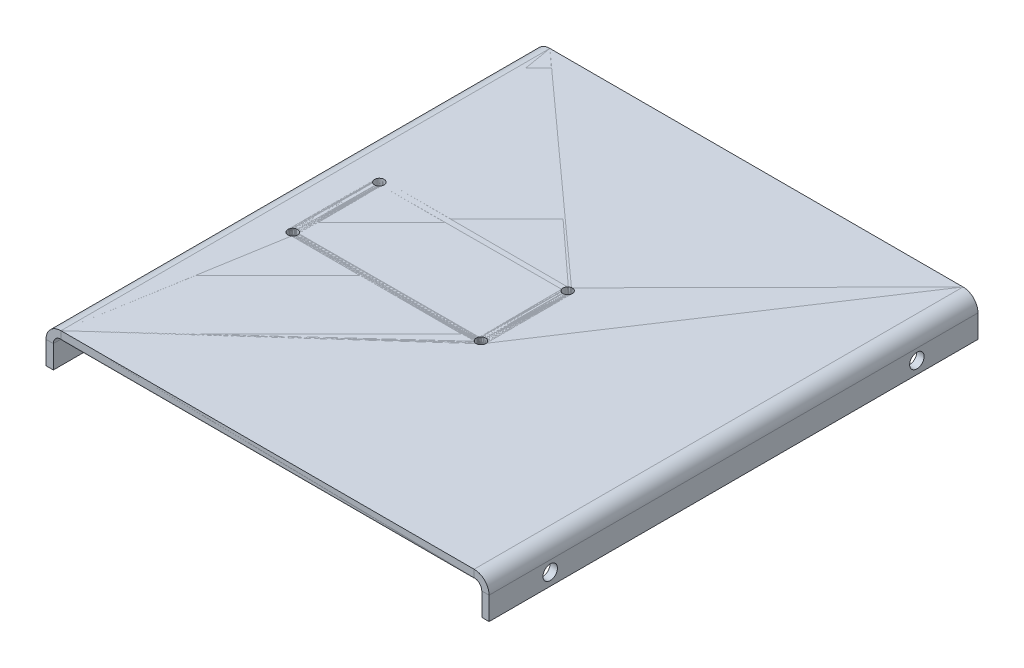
ISO-10303-21;
HEADER;
FILE_DESCRIPTION(('STEP AP214'),'2;1');
FILE_NAME('part.step','',(''),(''),'','','');
FILE_SCHEMA(('AUTOMOTIVE_DESIGN { 1 0 10303 214 1 1 1 1 }'));
ENDSEC;
DATA;
#1=APPLICATION_CONTEXT('core data for automotive mechanical design processes');
#2=APPLICATION_PROTOCOL_DEFINITION('international standard','automotive_design',2000,#1);
#3=PRODUCT_CONTEXT('',#1,'mechanical');
#4=PRODUCT('Part','Part','',(#3));
#5=PRODUCT_RELATED_PRODUCT_CATEGORY('part','',(#4));
#6=PRODUCT_DEFINITION_FORMATION('','',#4);
#7=PRODUCT_DEFINITION_CONTEXT('part definition',#1,'design');
#8=PRODUCT_DEFINITION('design','',#6,#7);
#9=PRODUCT_DEFINITION_SHAPE('','',#8);
#10=(LENGTH_UNIT() NAMED_UNIT(*) SI_UNIT(.MILLI.,.METRE.));
#11=(NAMED_UNIT(*) PLANE_ANGLE_UNIT() SI_UNIT($,.RADIAN.));
#12=(NAMED_UNIT(*) SI_UNIT($,.STERADIAN.) SOLID_ANGLE_UNIT());
#13=UNCERTAINTY_MEASURE_WITH_UNIT(LENGTH_MEASURE(1.E-05),#10,'distance_accuracy_value','');
#14=(GEOMETRIC_REPRESENTATION_CONTEXT(3) GLOBAL_UNCERTAINTY_ASSIGNED_CONTEXT((#13)) GLOBAL_UNIT_ASSIGNED_CONTEXT((#10,
#11,#12)) REPRESENTATION_CONTEXT('',''));
#15=CARTESIAN_POINT('',(0.,0.,0.));
#16=DIRECTION('',(0.,0.,1.));
#17=DIRECTION('',(1.,0.,0.));
#18=AXIS2_PLACEMENT_3D('',#15,#16,#17);
#19=CARTESIAN_POINT('',(0.,1.5875,-101.6));
#20=DIRECTION('',(0.,0.,1.));
#21=DIRECTION('',(-1.,0.,0.));
#22=AXIS2_PLACEMENT_3D('',#19,#20,#21);
#23=PLANE('',#22);
#24=DIRECTION('',(0.,1.,0.));
#25=VECTOR('',#24,1.);
#26=CARTESIAN_POINT('',(85.859,1.5875,-101.6));
#27=LINE('',#26,#25);
#28=CARTESIAN_POINT('',(85.859,0.0634999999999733,-101.6));
#29=VERTEX_POINT('',#28);
#30=CARTESIAN_POINT('',(85.859,1.5875,-101.6));
#31=VERTEX_POINT('',#30);
#32=EDGE_CURVE('E105',#29,#31,#27,.T.);
#33=ORIENTED_EDGE('',*,*,#32,.F.);
#34=DIRECTION('',(1.,0.,0.));
#35=VECTOR('',#34,1.);
#36=CARTESIAN_POINT('',(0.,0.0635,-101.6));
#37=LINE('',#36,#35);
#38=CARTESIAN_POINT('',(0.,0.0634999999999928,-101.6));
#39=VERTEX_POINT('',#38);
#40=EDGE_CURVE('E339',#29,#39,#37,.F.);
#41=ORIENTED_EDGE('',*,*,#40,.T.);
#42=DIRECTION('',(0.,1.,0.));
#43=VECTOR('',#42,1.);
#44=CARTESIAN_POINT('',(0.,1.5875,-101.6));
#45=LINE('',#44,#43);
#46=CARTESIAN_POINT('',(0.,1.58749999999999,-101.6));
#47=VERTEX_POINT('',#46);
#48=EDGE_CURVE('E351',#39,#47,#45,.T.);
#49=ORIENTED_EDGE('',*,*,#48,.T.);
#50=DIRECTION('',(-1.,0.,0.));
#51=VECTOR('',#50,1.);
#52=CARTESIAN_POINT('',(0.,1.5875,-101.6));
#53=LINE('',#52,#51);
#54=EDGE_CURVE('E322',#31,#47,#53,.T.);
#55=ORIENTED_EDGE('',*,*,#54,.F.);
#56=EDGE_LOOP('',(#33,#41,#49,#55));
#57=FACE_BOUND('',#56,.T.);
#58=ADVANCED_FACE('F96',(#57),#23,.F.);
#59=CARTESIAN_POINT('',(45.466,1.5875,-41.817));
#60=DIRECTION('',(0.,1.,0.));
#61=DIRECTION('',(0.,0.,1.));
#62=AXIS2_PLACEMENT_3D('',#59,#60,#61);
#63=CYLINDRICAL_SURFACE('',#62,0.999999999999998);
#64=CARTESIAN_POINT('',(45.466,1.5875,-41.817));
#65=DIRECTION('',(0.,1.,0.));
#66=DIRECTION('',(0.,0.,-1.));
#67=AXIS2_PLACEMENT_3D('',#64,#65,#66);
#68=CIRCLE('',#67,0.999999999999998);
#69=CARTESIAN_POINT('',(45.466,1.5875,-42.817));
#70=VERTEX_POINT('',#69);
#71=EDGE_CURVE('E308',#70,#70,#68,.T.);
#72=ORIENTED_EDGE('',*,*,#71,.T.);
#73=EDGE_LOOP('',(#72));
#74=FACE_BOUND('',#73,.T.);
#75=CARTESIAN_POINT('',(45.466,0.0635,-41.817));
#76=DIRECTION('',(0.,1.,0.));
#77=DIRECTION('',(0.,0.,1.));
#78=AXIS2_PLACEMENT_3D('',#75,#76,#77);
#79=CIRCLE('',#78,0.999999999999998);
#80=CARTESIAN_POINT('',(45.466,0.0635,-40.817));
#81=VERTEX_POINT('',#80);
#82=EDGE_CURVE('E299',#81,#81,#79,.T.);
#83=ORIENTED_EDGE('',*,*,#82,.F.);
#84=EDGE_LOOP('',(#83));
#85=FACE_BOUND('',#84,.T.);
#86=ADVANCED_FACE('F417',(#74,#85),#63,.F.);
#87=CARTESIAN_POINT('',(6.34999999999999,1.5875,-59.817));
#88=DIRECTION('',(0.,1.,0.));
#89=DIRECTION('',(0.,0.,1.));
#90=AXIS2_PLACEMENT_3D('',#87,#88,#89);
#91=CYLINDRICAL_SURFACE('',#90,1.);
#92=CARTESIAN_POINT('',(6.34999999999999,1.5875,-59.817));
#93=DIRECTION('',(0.,1.,0.));
#94=DIRECTION('',(0.,0.,1.));
#95=AXIS2_PLACEMENT_3D('',#92,#93,#94);
#96=CIRCLE('',#95,1.);
#97=CARTESIAN_POINT('',(6.34999999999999,1.5875,-58.817));
#98=VERTEX_POINT('',#97);
#99=EDGE_CURVE('E311',#98,#98,#96,.T.);
#100=ORIENTED_EDGE('',*,*,#99,.T.);
#101=EDGE_LOOP('',(#100));
#102=FACE_BOUND('',#101,.T.);
#103=CARTESIAN_POINT('',(6.34999999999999,0.0635,-59.817));
#104=DIRECTION('',(0.,1.,0.));
#105=DIRECTION('',(0.,0.,1.));
#106=AXIS2_PLACEMENT_3D('',#103,#104,#105);
#107=CIRCLE('',#106,1.);
#108=CARTESIAN_POINT('',(6.34999999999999,0.0635,-58.817));
#109=VERTEX_POINT('',#108);
#110=EDGE_CURVE('E333',#109,#109,#107,.T.);
#111=ORIENTED_EDGE('',*,*,#110,.F.);
#112=EDGE_LOOP('',(#111));
#113=FACE_BOUND('',#112,.T.);
#114=ADVANCED_FACE('F422',(#102,#113),#91,.F.);
#115=CARTESIAN_POINT('',(0.,1.5875,0.));
#116=DIRECTION('',(0.,0.,-1.));
#117=DIRECTION('',(1.,0.,0.));
#118=AXIS2_PLACEMENT_3D('',#115,#116,#117);
#119=PLANE('',#118);
#120=DIRECTION('',(1.,0.,0.));
#121=VECTOR('',#120,1.);
#122=CARTESIAN_POINT('',(0.,0.0635,0.));
#123=LINE('',#122,#121);
#124=CARTESIAN_POINT('',(0.,0.0634999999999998,0.));
#125=VERTEX_POINT('',#124);
#126=CARTESIAN_POINT('',(85.859,0.0634999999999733,0.));
#127=VERTEX_POINT('',#126);
#128=EDGE_CURVE('E338',#125,#127,#123,.T.);
#129=ORIENTED_EDGE('',*,*,#128,.T.);
#130=DIRECTION('',(0.,1.,0.));
#131=VECTOR('',#130,1.);
#132=CARTESIAN_POINT('',(85.859,1.5875,0.));
#133=LINE('',#132,#131);
#134=CARTESIAN_POINT('',(85.859,1.58749999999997,0.));
#135=VERTEX_POINT('',#134);
#136=EDGE_CURVE('E14',#127,#135,#133,.T.);
#137=ORIENTED_EDGE('',*,*,#136,.T.);
#138=DIRECTION('',(1.,0.,0.));
#139=VECTOR('',#138,1.);
#140=CARTESIAN_POINT('',(0.,1.5875,0.));
#141=LINE('',#140,#139);
#142=CARTESIAN_POINT('',(0.,1.5875,0.));
#143=VERTEX_POINT('',#142);
#144=EDGE_CURVE('E318',#143,#135,#141,.T.);
#145=ORIENTED_EDGE('',*,*,#144,.F.);
#146=DIRECTION('',(0.,1.,0.));
#147=VECTOR('',#146,1.);
#148=CARTESIAN_POINT('',(0.,1.5875,0.));
#149=LINE('',#148,#147);
#150=EDGE_CURVE('E100',#125,#143,#149,.T.);
#151=ORIENTED_EDGE('',*,*,#150,.F.);
#152=EDGE_LOOP('',(#129,#137,#145,#151));
#153=FACE_BOUND('',#152,.T.);
#154=ADVANCED_FACE('F380',(#153),#119,.F.);
#155=CARTESIAN_POINT('',(45.466,1.5875,-59.817));
#156=DIRECTION('',(0.,1.,0.));
#157=DIRECTION('',(0.,0.,1.));
#158=AXIS2_PLACEMENT_3D('',#155,#156,#157);
#159=CYLINDRICAL_SURFACE('',#158,0.999999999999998);
#160=CARTESIAN_POINT('',(45.466,1.5875,-59.817));
#161=DIRECTION('',(0.,1.,0.));
#162=DIRECTION('',(0.,0.,1.));
#163=AXIS2_PLACEMENT_3D('',#160,#161,#162);
#164=CIRCLE('',#163,0.999999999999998);
#165=CARTESIAN_POINT('',(45.466,1.5875,-58.817));
#166=VERTEX_POINT('',#165);
#167=EDGE_CURVE('E325',#166,#166,#164,.T.);
#168=ORIENTED_EDGE('',*,*,#167,.T.);
#169=EDGE_LOOP('',(#168));
#170=FACE_BOUND('',#169,.T.);
#171=CARTESIAN_POINT('',(45.466,0.0635,-59.817));
#172=DIRECTION('',(0.,1.,0.));
#173=DIRECTION('',(0.,0.,1.));
#174=AXIS2_PLACEMENT_3D('',#171,#172,#173);
#175=CIRCLE('',#174,0.999999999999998);
#176=CARTESIAN_POINT('',(45.466,0.0635,-58.817));
#177=VERTEX_POINT('',#176);
#178=EDGE_CURVE('E342',#177,#177,#175,.T.);
#179=ORIENTED_EDGE('',*,*,#178,.F.);
#180=EDGE_LOOP('',(#179));
#181=FACE_BOUND('',#180,.T.);
#182=ADVANCED_FACE('F428',(#170,#181),#159,.F.);
#183=CARTESIAN_POINT('',(6.34999999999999,1.5875,-41.817));
#184=DIRECTION('',(0.,1.,0.));
#185=DIRECTION('',(0.,0.,1.));
#186=AXIS2_PLACEMENT_3D('',#183,#184,#185);
#187=CYLINDRICAL_SURFACE('',#186,1.);
#188=CARTESIAN_POINT('',(6.34999999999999,1.5875,-41.817));
#189=DIRECTION('',(0.,1.,0.));
#190=DIRECTION('',(0.,0.,-1.));
#191=AXIS2_PLACEMENT_3D('',#188,#189,#190);
#192=CIRCLE('',#191,1.);
#193=CARTESIAN_POINT('',(6.34999999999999,1.5875,-42.817));
#194=VERTEX_POINT('',#193);
#195=EDGE_CURVE('E328',#194,#194,#192,.T.);
#196=ORIENTED_EDGE('',*,*,#195,.T.);
#197=EDGE_LOOP('',(#196));
#198=FACE_BOUND('',#197,.T.);
#199=CARTESIAN_POINT('',(6.34999999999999,0.0635,-41.817));
#200=DIRECTION('',(0.,1.,0.));
#201=DIRECTION('',(0.,0.,1.));
#202=AXIS2_PLACEMENT_3D('',#199,#200,#201);
#203=CIRCLE('',#202,1.);
#204=CARTESIAN_POINT('',(6.34999999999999,0.0635,-40.817));
#205=VERTEX_POINT('',#204);
#206=EDGE_CURVE('E312',#205,#205,#203,.T.);
#207=ORIENTED_EDGE('',*,*,#206,.F.);
#208=EDGE_LOOP('',(#207));
#209=FACE_BOUND('',#208,.T.);
#210=ADVANCED_FACE('F98',(#198,#209),#187,.F.);
#211=CARTESIAN_POINT('',(0.,1.5875,0.));
#212=DIRECTION('',(0.,-1.,0.));
#213=DIRECTION('',(0.,0.,-1.));
#214=AXIS2_PLACEMENT_3D('',#211,#212,#213);
#215=PLANE('',#214);
#216=ORIENTED_EDGE('',*,*,#71,.F.);
#217=EDGE_LOOP('',(#216));
#218=FACE_BOUND('',#217,.T.);
#219=ORIENTED_EDGE('',*,*,#99,.F.);
#220=EDGE_LOOP('',(#219));
#221=FACE_BOUND('',#220,.T.);
#222=DIRECTION('',(0.,0.,1.));
#223=VECTOR('',#222,1.);
#224=CARTESIAN_POINT('',(0.,1.5875,0.));
#225=LINE('',#224,#223);
#226=EDGE_CURVE('E315',#47,#143,#225,.T.);
#227=ORIENTED_EDGE('',*,*,#226,.T.);
#228=ORIENTED_EDGE('',*,*,#144,.T.);
#229=DIRECTION('',(0.,0.,-1.));
#230=VECTOR('',#229,1.);
#231=CARTESIAN_POINT('',(85.859,1.5875,0.));
#232=LINE('',#231,#230);
#233=EDGE_CURVE('E190',#135,#31,#232,.T.);
#234=ORIENTED_EDGE('',*,*,#233,.T.);
#235=ORIENTED_EDGE('',*,*,#54,.T.);
#236=EDGE_LOOP('',(#227,#228,#234,#235));
#237=FACE_BOUND('',#236,.T.);
#238=ORIENTED_EDGE('',*,*,#167,.F.);
#239=EDGE_LOOP('',(#238));
#240=FACE_BOUND('',#239,.T.);
#241=ORIENTED_EDGE('',*,*,#195,.F.);
#242=EDGE_LOOP('',(#241));
#243=FACE_BOUND('',#242,.T.);
#244=ADVANCED_FACE('F362',(#218,#221,#237,#240,#243),#215,.F.);
#245=CARTESIAN_POINT('',(0.,0.0635,0.));
#246=DIRECTION('',(0.,-1.,0.));
#247=DIRECTION('',(0.,0.,-1.));
#248=AXIS2_PLACEMENT_3D('',#245,#246,#247);
#249=PLANE('',#248);
#250=ORIENTED_EDGE('',*,*,#82,.T.);
#251=EDGE_LOOP('',(#250));
#252=FACE_BOUND('',#251,.T.);
#253=ORIENTED_EDGE('',*,*,#110,.T.);
#254=EDGE_LOOP('',(#253));
#255=FACE_BOUND('',#254,.T.);
#256=DIRECTION('',(0.,0.,-1.));
#257=VECTOR('',#256,1.);
#258=CARTESIAN_POINT('',(0.,0.0635,0.));
#259=LINE('',#258,#257);
#260=EDGE_CURVE('E336',#39,#125,#259,.F.);
#261=ORIENTED_EDGE('',*,*,#260,.F.);
#262=ORIENTED_EDGE('',*,*,#40,.F.);
#263=DIRECTION('',(0.,0.,-1.));
#264=VECTOR('',#263,1.);
#265=CARTESIAN_POINT('',(85.859,0.0635,0.));
#266=LINE('',#265,#264);
#267=EDGE_CURVE('E343',#127,#29,#266,.T.);
#268=ORIENTED_EDGE('',*,*,#267,.F.);
#269=ORIENTED_EDGE('',*,*,#128,.F.);
#270=EDGE_LOOP('',(#261,#262,#268,#269));
#271=FACE_BOUND('',#270,.T.);
#272=ORIENTED_EDGE('',*,*,#178,.T.);
#273=EDGE_LOOP('',(#272));
#274=FACE_BOUND('',#273,.T.);
#275=ORIENTED_EDGE('',*,*,#206,.T.);
#276=EDGE_LOOP('',(#275));
#277=FACE_BOUND('',#276,.T.);
#278=ADVANCED_FACE('F375',(#252,#255,#271,#274,#277),#249,.T.);
#279=CARTESIAN_POINT('',(0.,-1.524,0.));
#280=DIRECTION('',(0.,0.,1.));
#281=DIRECTION('',(1.,0.,0.));
#282=AXIS2_PLACEMENT_3D('',#279,#280,#281);
#283=PLANE('',#282);
#284=DIRECTION('',(-1.,0.,0.));
#285=VECTOR('',#284,1.);
#286=CARTESIAN_POINT('',(-3.1115,-1.52399999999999,0.));
#287=LINE('',#286,#285);
#288=CARTESIAN_POINT('',(-1.5875,-1.52399999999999,0.));
#289=VERTEX_POINT('',#288);
#290=CARTESIAN_POINT('',(-3.1115,-1.52399999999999,0.));
#291=VERTEX_POINT('',#290);
#292=EDGE_CURVE('E249',#289,#291,#287,.T.);
#293=ORIENTED_EDGE('',*,*,#292,.F.);
#294=CARTESIAN_POINT('',(0.,-1.524,0.));
#295=DIRECTION('',(0.,0.,-1.));
#296=DIRECTION('',(-1.,0.,0.));
#297=AXIS2_PLACEMENT_3D('',#294,#295,#296);
#298=CIRCLE('',#297,1.5875);
#299=EDGE_CURVE('E303',#125,#289,#298,.F.);
#300=ORIENTED_EDGE('',*,*,#299,.F.);
#301=ORIENTED_EDGE('',*,*,#150,.T.);
#302=CARTESIAN_POINT('',(0.,-1.524,0.));
#303=DIRECTION('',(0.,0.,-1.));
#304=DIRECTION('',(-1.,0.,0.));
#305=AXIS2_PLACEMENT_3D('',#302,#303,#304);
#306=CIRCLE('',#305,3.1115);
#307=EDGE_CURVE('E120',#143,#291,#306,.F.);
#308=ORIENTED_EDGE('',*,*,#307,.T.);
#309=EDGE_LOOP('',(#293,#300,#301,#308));
#310=FACE_BOUND('',#309,.T.);
#311=ADVANCED_FACE('F382',(#310),#283,.T.);
#312=CARTESIAN_POINT('',(0.,-1.524,-101.6));
#313=DIRECTION('',(0.,0.,1.));
#314=DIRECTION('',(1.,0.,0.));
#315=AXIS2_PLACEMENT_3D('',#312,#313,#314);
#316=PLANE('',#315);
#317=CARTESIAN_POINT('',(0.,-1.524,-101.6));
#318=DIRECTION('',(0.,0.,-1.));
#319=DIRECTION('',(-1.,0.,0.));
#320=AXIS2_PLACEMENT_3D('',#317,#318,#319);
#321=CIRCLE('',#320,1.5875);
#322=CARTESIAN_POINT('',(-1.58750000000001,-1.524,-101.6));
#323=VERTEX_POINT('',#322);
#324=EDGE_CURVE('E256',#323,#39,#321,.T.);
#325=ORIENTED_EDGE('',*,*,#324,.F.);
#326=DIRECTION('',(-1.,0.,0.));
#327=VECTOR('',#326,1.);
#328=CARTESIAN_POINT('',(-1.58750000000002,-1.524,-101.6));
#329=LINE('',#328,#327);
#330=CARTESIAN_POINT('',(-3.11150000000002,-1.52399999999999,-101.6));
#331=VERTEX_POINT('',#330);
#332=EDGE_CURVE('E291',#323,#331,#329,.T.);
#333=ORIENTED_EDGE('',*,*,#332,.T.);
#334=CARTESIAN_POINT('',(0.,-1.524,-101.6));
#335=DIRECTION('',(0.,0.,-1.));
#336=DIRECTION('',(-1.,0.,0.));
#337=AXIS2_PLACEMENT_3D('',#334,#335,#336);
#338=CIRCLE('',#337,3.1115);
#339=EDGE_CURVE('E300',#331,#47,#338,.T.);
#340=ORIENTED_EDGE('',*,*,#339,.T.);
#341=ORIENTED_EDGE('',*,*,#48,.F.);
#342=EDGE_LOOP('',(#325,#333,#340,#341));
#343=FACE_BOUND('',#342,.T.);
#344=ADVANCED_FACE('F367',(#343),#316,.F.);
#345=CARTESIAN_POINT('',(0.,-1.524,-101.6));
#346=DIRECTION('',(0.,0.,-1.));
#347=DIRECTION('',(-1.,0.,0.));
#348=AXIS2_PLACEMENT_3D('',#345,#346,#347);
#349=CYLINDRICAL_SURFACE('',#348,3.1115);
#350=ORIENTED_EDGE('',*,*,#226,.F.);
#351=ORIENTED_EDGE('',*,*,#339,.F.);
#352=DIRECTION('',(0.,0.,-1.));
#353=VECTOR('',#352,1.);
#354=CARTESIAN_POINT('',(-3.1115,-1.52399999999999,0.));
#355=LINE('',#354,#353);
#356=EDGE_CURVE('E288',#291,#331,#355,.T.);
#357=ORIENTED_EDGE('',*,*,#356,.F.);
#358=ORIENTED_EDGE('',*,*,#307,.F.);
#359=EDGE_LOOP('',(#350,#351,#357,#358));
#360=FACE_BOUND('',#359,.T.);
#361=ADVANCED_FACE('F383',(#360),#349,.T.);
#362=CARTESIAN_POINT('',(0.,-1.524,-101.6));
#363=DIRECTION('',(0.,0.,-1.));
#364=DIRECTION('',(-1.,0.,0.));
#365=AXIS2_PLACEMENT_3D('',#362,#363,#364);
#366=CYLINDRICAL_SURFACE('',#365,1.5875);
#367=ORIENTED_EDGE('',*,*,#260,.T.);
#368=ORIENTED_EDGE('',*,*,#299,.T.);
#369=DIRECTION('',(0.,0.,1.));
#370=VECTOR('',#369,1.);
#371=CARTESIAN_POINT('',(-1.5875,-1.52399999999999,0.));
#372=LINE('',#371,#370);
#373=EDGE_CURVE('E294',#289,#323,#372,.F.);
#374=ORIENTED_EDGE('',*,*,#373,.T.);
#375=ORIENTED_EDGE('',*,*,#324,.T.);
#376=EDGE_LOOP('',(#367,#368,#374,#375));
#377=FACE_BOUND('',#376,.T.);
#378=ADVANCED_FACE('F370',(#377),#366,.F.);
#379=CARTESIAN_POINT('',(-3.11150000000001,0.0635000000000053,-101.6));
#380=DIRECTION('',(0.,0.,-1.));
#381=DIRECTION('',(-1.,0.,0.));
#382=AXIS2_PLACEMENT_3D('',#379,#380,#381);
#383=PLANE('',#382);
#384=DIRECTION('',(0.,1.,0.));
#385=VECTOR('',#384,1.);
#386=CARTESIAN_POINT('',(-3.11150000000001,0.0635000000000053,-101.6));
#387=LINE('',#386,#385);
#388=CARTESIAN_POINT('',(-3.11150000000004,-6.28649999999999,-101.6));
#389=VERTEX_POINT('',#388);
#390=EDGE_CURVE('E260',#389,#331,#387,.T.);
#391=ORIENTED_EDGE('',*,*,#390,.T.);
#392=ORIENTED_EDGE('',*,*,#332,.F.);
#393=DIRECTION('',(0.,-1.,0.));
#394=VECTOR('',#393,1.);
#395=CARTESIAN_POINT('',(-1.58750000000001,0.,-101.6));
#396=LINE('',#395,#394);
#397=CARTESIAN_POINT('',(-1.58750000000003,-6.2865,-101.6));
#398=VERTEX_POINT('',#397);
#399=EDGE_CURVE('E268',#398,#323,#396,.F.);
#400=ORIENTED_EDGE('',*,*,#399,.F.);
#401=DIRECTION('',(1.,0.,0.));
#402=VECTOR('',#401,1.);
#403=CARTESIAN_POINT('',(-3.11150000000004,-6.28649999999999,-101.6));
#404=LINE('',#403,#402);
#405=EDGE_CURVE('E254',#389,#398,#404,.T.);
#406=ORIENTED_EDGE('',*,*,#405,.F.);
#407=EDGE_LOOP('',(#391,#392,#400,#406));
#408=FACE_BOUND('',#407,.T.);
#409=ADVANCED_FACE('F392',(#408),#383,.T.);
#410=CARTESIAN_POINT('',(-3.11150000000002,-6.28649999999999,0.));
#411=DIRECTION('',(0.,0.,1.));
#412=DIRECTION('',(1.,0.,0.));
#413=AXIS2_PLACEMENT_3D('',#410,#411,#412);
#414=PLANE('',#413);
#415=DIRECTION('',(0.,1.,0.));
#416=VECTOR('',#415,1.);
#417=CARTESIAN_POINT('',(-1.58749999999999,0.,0.));
#418=LINE('',#417,#416);
#419=CARTESIAN_POINT('',(-1.58750000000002,-6.2865,0.));
#420=VERTEX_POINT('',#419);
#421=EDGE_CURVE('E274',#289,#420,#418,.F.);
#422=ORIENTED_EDGE('',*,*,#421,.F.);
#423=ORIENTED_EDGE('',*,*,#292,.T.);
#424=DIRECTION('',(0.,-1.,0.));
#425=VECTOR('',#424,1.);
#426=CARTESIAN_POINT('',(-3.11150000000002,-6.28649999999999,0.));
#427=LINE('',#426,#425);
#428=CARTESIAN_POINT('',(-3.11150000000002,-6.28649999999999,0.));
#429=VERTEX_POINT('',#428);
#430=EDGE_CURVE('E266',#291,#429,#427,.T.);
#431=ORIENTED_EDGE('',*,*,#430,.T.);
#432=DIRECTION('',(1.,0.,0.));
#433=VECTOR('',#432,1.);
#434=CARTESIAN_POINT('',(-3.11150000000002,-6.28649999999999,0.));
#435=LINE('',#434,#433);
#436=EDGE_CURVE('E257',#429,#420,#435,.T.);
#437=ORIENTED_EDGE('',*,*,#436,.T.);
#438=EDGE_LOOP('',(#422,#423,#431,#437));
#439=FACE_BOUND('',#438,.T.);
#440=ADVANCED_FACE('F399',(#439),#414,.T.);
#441=CARTESIAN_POINT('',(-3.11149999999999,0.,0.));
#442=DIRECTION('',(-1.,0.,0.));
#443=DIRECTION('',(0.,-1.,0.));
#444=AXIS2_PLACEMENT_3D('',#441,#442,#443);
#445=PLANE('',#444);
#446=CARTESIAN_POINT('',(-3.11150000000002,-3.74649999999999,-88.9));
#447=DIRECTION('',(-1.,0.,0.));
#448=DIRECTION('',(0.,-1.,0.));
#449=AXIS2_PLACEMENT_3D('',#446,#447,#448);
#450=CIRCLE('',#449,1.5);
#451=CARTESIAN_POINT('',(-3.11150000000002,-2.2465,-88.9));
#452=VERTEX_POINT('',#451);
#453=EDGE_CURVE('E276',#452,#452,#450,.F.);
#454=ORIENTED_EDGE('',*,*,#453,.T.);
#455=EDGE_LOOP('',(#454));
#456=FACE_BOUND('',#455,.T.);
#457=CARTESIAN_POINT('',(-3.11150000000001,-3.74649999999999,-12.7));
#458=DIRECTION('',(-1.,0.,0.));
#459=DIRECTION('',(0.,-1.,0.));
#460=AXIS2_PLACEMENT_3D('',#457,#458,#459);
#461=CIRCLE('',#460,1.5);
#462=CARTESIAN_POINT('',(-3.1115,-2.24649999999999,-12.7));
#463=VERTEX_POINT('',#462);
#464=EDGE_CURVE('E282',#463,#463,#461,.F.);
#465=ORIENTED_EDGE('',*,*,#464,.T.);
#466=EDGE_LOOP('',(#465));
#467=FACE_BOUND('',#466,.T.);
#468=ORIENTED_EDGE('',*,*,#430,.F.);
#469=ORIENTED_EDGE('',*,*,#356,.T.);
#470=ORIENTED_EDGE('',*,*,#390,.F.);
#471=DIRECTION('',(0.,0.,-1.));
#472=VECTOR('',#471,1.);
#473=CARTESIAN_POINT('',(-3.11150000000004,-6.28649999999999,-101.6));
#474=LINE('',#473,#472);
#475=EDGE_CURVE('E263',#429,#389,#474,.T.);
#476=ORIENTED_EDGE('',*,*,#475,.F.);
#477=EDGE_LOOP('',(#468,#469,#470,#476));
#478=FACE_BOUND('',#477,.T.);
#479=ADVANCED_FACE('F390',(#456,#467,#478),#445,.T.);
#480=CARTESIAN_POINT('',(-1.58749999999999,0.,0.));
#481=DIRECTION('',(-1.,0.,0.));
#482=DIRECTION('',(0.,-1.,0.));
#483=AXIS2_PLACEMENT_3D('',#480,#481,#482);
#484=PLANE('',#483);
#485=CARTESIAN_POINT('',(-1.58750000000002,-3.7465,-88.9));
#486=DIRECTION('',(-1.,0.,0.));
#487=DIRECTION('',(0.,-1.,0.));
#488=AXIS2_PLACEMENT_3D('',#485,#486,#487);
#489=CIRCLE('',#488,1.5);
#490=CARTESIAN_POINT('',(-1.58750000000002,-2.2465,-88.9));
#491=VERTEX_POINT('',#490);
#492=EDGE_CURVE('E279',#491,#491,#489,.F.);
#493=ORIENTED_EDGE('',*,*,#492,.F.);
#494=EDGE_LOOP('',(#493));
#495=FACE_BOUND('',#494,.T.);
#496=CARTESIAN_POINT('',(-1.58750000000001,-3.7465,-12.7));
#497=DIRECTION('',(-1.,0.,0.));
#498=DIRECTION('',(0.,-1.,0.));
#499=AXIS2_PLACEMENT_3D('',#496,#497,#498);
#500=CIRCLE('',#499,1.5);
#501=CARTESIAN_POINT('',(-1.5875,-2.2465,-12.7));
#502=VERTEX_POINT('',#501);
#503=EDGE_CURVE('E285',#502,#502,#500,.F.);
#504=ORIENTED_EDGE('',*,*,#503,.F.);
#505=EDGE_LOOP('',(#504));
#506=FACE_BOUND('',#505,.T.);
#507=ORIENTED_EDGE('',*,*,#373,.F.);
#508=ORIENTED_EDGE('',*,*,#421,.T.);
#509=DIRECTION('',(0.,0.,1.));
#510=VECTOR('',#509,1.);
#511=CARTESIAN_POINT('',(-1.58750000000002,-6.2865,0.));
#512=LINE('',#511,#510);
#513=EDGE_CURVE('E271',#420,#398,#512,.F.);
#514=ORIENTED_EDGE('',*,*,#513,.T.);
#515=ORIENTED_EDGE('',*,*,#399,.T.);
#516=EDGE_LOOP('',(#507,#508,#514,#515));
#517=FACE_BOUND('',#516,.T.);
#518=ADVANCED_FACE('F401',(#495,#506,#517),#484,.F.);
#519=CARTESIAN_POINT('',(-3.11150000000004,-6.28649999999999,-101.6));
#520=DIRECTION('',(0.,-1.,0.));
#521=DIRECTION('',(1.,0.,0.));
#522=AXIS2_PLACEMENT_3D('',#519,#520,#521);
#523=PLANE('',#522);
#524=ORIENTED_EDGE('',*,*,#513,.F.);
#525=ORIENTED_EDGE('',*,*,#436,.F.);
#526=ORIENTED_EDGE('',*,*,#475,.T.);
#527=ORIENTED_EDGE('',*,*,#405,.T.);
#528=EDGE_LOOP('',(#524,#525,#526,#527));
#529=FACE_BOUND('',#528,.T.);
#530=ADVANCED_FACE('F396',(#529),#523,.T.);
#531=CARTESIAN_POINT('',(-3.11150000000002,-3.74649999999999,-88.9));
#532=DIRECTION('',(1.,0.,0.));
#533=DIRECTION('',(0.,1.,0.));
#534=AXIS2_PLACEMENT_3D('',#531,#532,#533);
#535=CYLINDRICAL_SURFACE('',#534,1.5);
#536=CARTESIAN_POINT('',(-3.11150000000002,-2.2465,-88.9));
#537=CARTESIAN_POINT('',(-3.09562500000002,-2.2465,-88.9));
#538=CARTESIAN_POINT('',(-3.07975000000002,-2.2465,-88.9));
#539=CARTESIAN_POINT('',(-3.04800000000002,-2.2465,-88.9));
#540=CARTESIAN_POINT('',(-3.03212500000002,-2.2465,-88.9));
#541=CARTESIAN_POINT('',(-3.00037500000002,-2.2465,-88.9));
#542=CARTESIAN_POINT('',(-2.98450000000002,-2.2465,-88.9));
#543=CARTESIAN_POINT('',(-2.95275000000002,-2.2465,-88.9));
#544=CARTESIAN_POINT('',(-2.93687500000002,-2.2465,-88.9));
#545=CARTESIAN_POINT('',(-2.90512500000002,-2.2465,-88.9));
#546=CARTESIAN_POINT('',(-2.88925000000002,-2.2465,-88.9));
#547=CARTESIAN_POINT('',(-2.85750000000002,-2.2465,-88.9));
#548=CARTESIAN_POINT('',(-2.84162500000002,-2.2465,-88.9));
#549=CARTESIAN_POINT('',(-2.80987500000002,-2.2465,-88.9));
#550=CARTESIAN_POINT('',(-2.79400000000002,-2.2465,-88.9));
#551=CARTESIAN_POINT('',(-2.76225000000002,-2.2465,-88.9));
#552=CARTESIAN_POINT('',(-2.74637500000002,-2.2465,-88.9));
#553=CARTESIAN_POINT('',(-2.71462500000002,-2.2465,-88.9));
#554=CARTESIAN_POINT('',(-2.69875000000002,-2.2465,-88.9));
#555=CARTESIAN_POINT('',(-2.66700000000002,-2.2465,-88.9));
#556=CARTESIAN_POINT('',(-2.65112500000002,-2.2465,-88.9));
#557=CARTESIAN_POINT('',(-2.61937500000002,-2.2465,-88.9));
#558=CARTESIAN_POINT('',(-2.60350000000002,-2.2465,-88.9));
#559=CARTESIAN_POINT('',(-2.57175000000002,-2.2465,-88.9));
#560=CARTESIAN_POINT('',(-2.55587500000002,-2.2465,-88.9));
#561=CARTESIAN_POINT('',(-2.52412500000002,-2.2465,-88.9));
#562=CARTESIAN_POINT('',(-2.50825000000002,-2.2465,-88.9));
#563=CARTESIAN_POINT('',(-2.47650000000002,-2.2465,-88.9));
#564=CARTESIAN_POINT('',(-2.46062500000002,-2.2465,-88.9));
#565=CARTESIAN_POINT('',(-2.42887500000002,-2.2465,-88.9));
#566=CARTESIAN_POINT('',(-2.41300000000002,-2.2465,-88.9));
#567=CARTESIAN_POINT('',(-2.38125000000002,-2.2465,-88.9));
#568=CARTESIAN_POINT('',(-2.36537500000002,-2.2465,-88.9));
#569=CARTESIAN_POINT('',(-2.33362500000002,-2.2465,-88.9));
#570=CARTESIAN_POINT('',(-2.31775000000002,-2.2465,-88.9));
#571=CARTESIAN_POINT('',(-2.28600000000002,-2.2465,-88.9));
#572=CARTESIAN_POINT('',(-2.27012500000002,-2.2465,-88.9));
#573=CARTESIAN_POINT('',(-2.23837500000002,-2.2465,-88.9));
#574=CARTESIAN_POINT('',(-2.22250000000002,-2.2465,-88.9));
#575=CARTESIAN_POINT('',(-2.19075000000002,-2.2465,-88.9));
#576=CARTESIAN_POINT('',(-2.17487500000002,-2.2465,-88.9));
#577=CARTESIAN_POINT('',(-2.14312500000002,-2.2465,-88.9));
#578=CARTESIAN_POINT('',(-2.12725000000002,-2.2465,-88.9));
#579=CARTESIAN_POINT('',(-2.09550000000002,-2.2465,-88.9));
#580=CARTESIAN_POINT('',(-2.07962500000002,-2.2465,-88.9));
#581=CARTESIAN_POINT('',(-2.04787500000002,-2.2465,-88.9));
#582=CARTESIAN_POINT('',(-2.03200000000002,-2.2465,-88.9));
#583=CARTESIAN_POINT('',(-2.00025000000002,-2.2465,-88.9));
#584=CARTESIAN_POINT('',(-1.98437500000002,-2.2465,-88.9));
#585=CARTESIAN_POINT('',(-1.95262500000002,-2.2465,-88.9));
#586=CARTESIAN_POINT('',(-1.93675000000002,-2.2465,-88.9));
#587=CARTESIAN_POINT('',(-1.90500000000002,-2.2465,-88.9));
#588=CARTESIAN_POINT('',(-1.88912500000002,-2.2465,-88.9));
#589=CARTESIAN_POINT('',(-1.85737500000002,-2.2465,-88.9));
#590=CARTESIAN_POINT('',(-1.84150000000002,-2.2465,-88.9));
#591=CARTESIAN_POINT('',(-1.80975000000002,-2.2465,-88.9));
#592=CARTESIAN_POINT('',(-1.79387500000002,-2.2465,-88.9));
#593=CARTESIAN_POINT('',(-1.76212500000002,-2.2465,-88.9));
#594=CARTESIAN_POINT('',(-1.74625000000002,-2.2465,-88.9));
#595=CARTESIAN_POINT('',(-1.71450000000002,-2.2465,-88.9));
#596=CARTESIAN_POINT('',(-1.69862500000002,-2.2465,-88.9));
#597=CARTESIAN_POINT('',(-1.66687500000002,-2.2465,-88.9));
#598=CARTESIAN_POINT('',(-1.65100000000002,-2.2465,-88.9));
#599=CARTESIAN_POINT('',(-1.61925000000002,-2.2465,-88.9));
#600=CARTESIAN_POINT('',(-1.60337500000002,-2.2465,-88.9));
#601=CARTESIAN_POINT('',(-1.58750000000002,-2.2465,-88.9));
#602=B_SPLINE_CURVE_WITH_KNOTS('',3,(#536,#537,#538,#539,#540,#541,#542,#543,#544,#545,#546,
#547,#548,#549,#550,#551,#552,#553,#554,#555,#556,#557,#558,#559,#560,#561,#562,#563,#564,#565,
#566,#567,#568,#569,#570,#571,#572,#573,#574,#575,#576,#577,#578,#579,#580,#581,#582,#583,#584,
#585,#586,#587,#588,#589,#590,#591,#592,#593,#594,#595,#596,#597,#598,#599,#600,#601),
.UNSPECIFIED.,.F.,.F.,(4,2,2,2,2,2,2,2,2,2,2,2,2,2,2,2,2,2,2,2,2,2,2,2,2,2,2,2,2,2,2,2,4),(0.,
0.0476250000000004,0.0952500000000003,0.142875,0.1905,0.238125,0.28575,0.333375,0.381,0.428625,
0.47625,0.523875,0.5715,0.619125,0.66675,0.714375,0.762000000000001,0.809625,0.85725,0.904875,
0.9525,1.000125,1.04775,1.095375,1.143,1.190625,1.23825,1.285875,1.3335,1.381125,1.42875,
1.476375,1.524),.UNSPECIFIED.);
#603=EDGE_CURVE('BSEAM409',#452,#491,#602,.T.);
#604=ORIENTED_EDGE('',*,*,#453,.F.);
#605=ORIENTED_EDGE('',*,*,#492,.T.);
#606=ORIENTED_EDGE('',*,*,#603,.T.);
#607=ORIENTED_EDGE('',*,*,#603,.F.);
#608=EDGE_LOOP('',(#604,#606,#605,#607));
#609=FACE_BOUND('',#608,.T.);
#610=ADVANCED_FACE('F409',(#609),#535,.F.);
#611=CARTESIAN_POINT('',(-3.11150000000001,-3.74649999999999,-12.7));
#612=DIRECTION('',(1.,0.,0.));
#613=DIRECTION('',(0.,1.,0.));
#614=AXIS2_PLACEMENT_3D('',#611,#612,#613);
#615=CYLINDRICAL_SURFACE('',#614,1.5);
#616=CARTESIAN_POINT('',(-3.1115,-2.24649999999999,-12.7));
#617=CARTESIAN_POINT('',(-3.095625,-2.24649999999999,-12.7));
#618=CARTESIAN_POINT('',(-3.07975,-2.24649999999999,-12.7));
#619=CARTESIAN_POINT('',(-3.048,-2.24649999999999,-12.7));
#620=CARTESIAN_POINT('',(-3.032125,-2.24649999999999,-12.7));
#621=CARTESIAN_POINT('',(-3.000375,-2.24649999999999,-12.7));
#622=CARTESIAN_POINT('',(-2.9845,-2.24649999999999,-12.7));
#623=CARTESIAN_POINT('',(-2.95275,-2.24649999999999,-12.7));
#624=CARTESIAN_POINT('',(-2.936875,-2.24649999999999,-12.7));
#625=CARTESIAN_POINT('',(-2.905125,-2.24649999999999,-12.7));
#626=CARTESIAN_POINT('',(-2.88925,-2.24649999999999,-12.7));
#627=CARTESIAN_POINT('',(-2.8575,-2.24649999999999,-12.7));
#628=CARTESIAN_POINT('',(-2.841625,-2.24649999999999,-12.7));
#629=CARTESIAN_POINT('',(-2.809875,-2.24649999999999,-12.7));
#630=CARTESIAN_POINT('',(-2.794,-2.2465,-12.7));
#631=CARTESIAN_POINT('',(-2.76225,-2.2465,-12.7));
#632=CARTESIAN_POINT('',(-2.746375,-2.2465,-12.7));
#633=CARTESIAN_POINT('',(-2.714625,-2.2465,-12.7));
#634=CARTESIAN_POINT('',(-2.69875,-2.2465,-12.7));
#635=CARTESIAN_POINT('',(-2.667,-2.2465,-12.7));
#636=CARTESIAN_POINT('',(-2.651125,-2.2465,-12.7));
#637=CARTESIAN_POINT('',(-2.61937500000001,-2.2465,-12.7));
#638=CARTESIAN_POINT('',(-2.6035,-2.2465,-12.7));
#639=CARTESIAN_POINT('',(-2.57175,-2.2465,-12.7));
#640=CARTESIAN_POINT('',(-2.555875,-2.2465,-12.7));
#641=CARTESIAN_POINT('',(-2.524125,-2.2465,-12.7));
#642=CARTESIAN_POINT('',(-2.50825,-2.2465,-12.7));
#643=CARTESIAN_POINT('',(-2.4765,-2.2465,-12.7));
#644=CARTESIAN_POINT('',(-2.460625,-2.2465,-12.7));
#645=CARTESIAN_POINT('',(-2.42887500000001,-2.2465,-12.7));
#646=CARTESIAN_POINT('',(-2.413,-2.2465,-12.7));
#647=CARTESIAN_POINT('',(-2.38125,-2.2465,-12.7));
#648=CARTESIAN_POINT('',(-2.365375,-2.2465,-12.7));
#649=CARTESIAN_POINT('',(-2.333625,-2.2465,-12.7));
#650=CARTESIAN_POINT('',(-2.31775,-2.2465,-12.7));
#651=CARTESIAN_POINT('',(-2.286,-2.2465,-12.7));
#652=CARTESIAN_POINT('',(-2.270125,-2.2465,-12.7));
#653=CARTESIAN_POINT('',(-2.238375,-2.2465,-12.7));
#654=CARTESIAN_POINT('',(-2.2225,-2.2465,-12.7));
#655=CARTESIAN_POINT('',(-2.19075,-2.2465,-12.7));
#656=CARTESIAN_POINT('',(-2.174875,-2.2465,-12.7));
#657=CARTESIAN_POINT('',(-2.143125,-2.2465,-12.7));
#658=CARTESIAN_POINT('',(-2.12725,-2.2465,-12.7));
#659=CARTESIAN_POINT('',(-2.0955,-2.2465,-12.7));
#660=CARTESIAN_POINT('',(-2.079625,-2.2465,-12.7));
#661=CARTESIAN_POINT('',(-2.047875,-2.2465,-12.7));
#662=CARTESIAN_POINT('',(-2.032,-2.2465,-12.7));
#663=CARTESIAN_POINT('',(-2.00025,-2.2465,-12.7));
#664=CARTESIAN_POINT('',(-1.984375,-2.2465,-12.7));
#665=CARTESIAN_POINT('',(-1.952625,-2.2465,-12.7));
#666=CARTESIAN_POINT('',(-1.93675,-2.2465,-12.7));
#667=CARTESIAN_POINT('',(-1.905,-2.2465,-12.7));
#668=CARTESIAN_POINT('',(-1.889125,-2.2465,-12.7));
#669=CARTESIAN_POINT('',(-1.857375,-2.2465,-12.7));
#670=CARTESIAN_POINT('',(-1.8415,-2.2465,-12.7));
#671=CARTESIAN_POINT('',(-1.80975,-2.2465,-12.7));
#672=CARTESIAN_POINT('',(-1.793875,-2.2465,-12.7));
#673=CARTESIAN_POINT('',(-1.762125,-2.2465,-12.7));
#674=CARTESIAN_POINT('',(-1.74625,-2.2465,-12.7));
#675=CARTESIAN_POINT('',(-1.7145,-2.2465,-12.7));
#676=CARTESIAN_POINT('',(-1.698625,-2.2465,-12.7));
#677=CARTESIAN_POINT('',(-1.666875,-2.2465,-12.7));
#678=CARTESIAN_POINT('',(-1.651,-2.2465,-12.7));
#679=CARTESIAN_POINT('',(-1.61925,-2.2465,-12.7));
#680=CARTESIAN_POINT('',(-1.603375,-2.2465,-12.7));
#681=CARTESIAN_POINT('',(-1.5875,-2.2465,-12.7));
#682=B_SPLINE_CURVE_WITH_KNOTS('',3,(#616,#617,#618,#619,#620,#621,#622,#623,#624,#625,#626,
#627,#628,#629,#630,#631,#632,#633,#634,#635,#636,#637,#638,#639,#640,#641,#642,#643,#644,#645,
#646,#647,#648,#649,#650,#651,#652,#653,#654,#655,#656,#657,#658,#659,#660,#661,#662,#663,#664,
#665,#666,#667,#668,#669,#670,#671,#672,#673,#674,#675,#676,#677,#678,#679,#680,#681),
.UNSPECIFIED.,.F.,.F.,(4,2,2,2,2,2,2,2,2,2,2,2,2,2,2,2,2,2,2,2,2,2,2,2,2,2,2,2,2,2,2,2,4),(0.,
0.0476250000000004,0.0952500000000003,0.142875,0.1905,0.238125,0.28575,0.333375,0.381,0.428625,
0.47625,0.523875,0.5715,0.619125,0.66675,0.714375,0.762000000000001,0.809625,0.85725,0.904875,
0.9525,1.000125,1.04775,1.095375,1.143,1.190625,1.23825,1.285875,1.3335,1.381125,1.42875,
1.476375,1.524),.UNSPECIFIED.);
#683=EDGE_CURVE('BSEAM495',#463,#502,#682,.T.);
#684=ORIENTED_EDGE('',*,*,#464,.F.);
#685=ORIENTED_EDGE('',*,*,#503,.T.);
#686=ORIENTED_EDGE('',*,*,#683,.T.);
#687=ORIENTED_EDGE('',*,*,#683,.F.);
#688=EDGE_LOOP('',(#684,#686,#685,#687));
#689=FACE_BOUND('',#688,.T.);
#690=ADVANCED_FACE('F495',(#689),#615,.F.);
#691=CARTESIAN_POINT('',(85.859,-1.524,-101.6));
#692=DIRECTION('',(0.,0.,-1.));
#693=DIRECTION('',(-1.,0.,0.));
#694=AXIS2_PLACEMENT_3D('',#691,#692,#693);
#695=PLANE('',#694);
#696=DIRECTION('',(1.,0.,0.));
#697=VECTOR('',#696,1.);
#698=CARTESIAN_POINT('',(88.9705,-1.52399999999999,-101.6));
#699=LINE('',#698,#697);
#700=CARTESIAN_POINT('',(87.4465,-1.524,-101.6));
#701=VERTEX_POINT('',#700);
#702=CARTESIAN_POINT('',(88.9705,-1.52399999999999,-101.6));
#703=VERTEX_POINT('',#702);
#704=EDGE_CURVE('E246',#701,#703,#699,.T.);
#705=ORIENTED_EDGE('',*,*,#704,.F.);
#706=CARTESIAN_POINT('',(85.859,-1.524,-101.6));
#707=DIRECTION('',(0.,0.,1.));
#708=DIRECTION('',(1.,0.,0.));
#709=AXIS2_PLACEMENT_3D('',#706,#707,#708);
#710=CIRCLE('',#709,1.58749999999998);
#711=EDGE_CURVE('E192',#29,#701,#710,.F.);
#712=ORIENTED_EDGE('',*,*,#711,.F.);
#713=ORIENTED_EDGE('',*,*,#32,.T.);
#714=CARTESIAN_POINT('',(85.859,-1.524,-101.6));
#715=DIRECTION('',(0.,0.,1.));
#716=DIRECTION('',(1.,0.,0.));
#717=AXIS2_PLACEMENT_3D('',#714,#715,#716);
#718=CIRCLE('',#717,3.11149999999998);
#719=EDGE_CURVE('E112',#31,#703,#718,.F.);
#720=ORIENTED_EDGE('',*,*,#719,.T.);
#721=EDGE_LOOP('',(#705,#712,#713,#720));
#722=FACE_BOUND('',#721,.T.);
#723=ADVANCED_FACE('F357',(#722),#695,.T.);
#724=CARTESIAN_POINT('',(85.859,-1.524,0.));
#725=DIRECTION('',(0.,0.,-1.));
#726=DIRECTION('',(-1.,0.,0.));
#727=AXIS2_PLACEMENT_3D('',#724,#725,#726);
#728=PLANE('',#727);
#729=CARTESIAN_POINT('',(85.859,-1.524,0.));
#730=DIRECTION('',(0.,0.,1.));
#731=DIRECTION('',(1.,0.,0.));
#732=AXIS2_PLACEMENT_3D('',#729,#730,#731);
#733=CIRCLE('',#732,1.58749999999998);
#734=CARTESIAN_POINT('',(87.4465,-1.524,0.));
#735=VERTEX_POINT('',#734);
#736=EDGE_CURVE('E199',#735,#127,#733,.T.);
#737=ORIENTED_EDGE('',*,*,#736,.F.);
#738=DIRECTION('',(1.,0.,0.));
#739=VECTOR('',#738,1.);
#740=CARTESIAN_POINT('',(87.4465,-1.524,0.));
#741=LINE('',#740,#739);
#742=CARTESIAN_POINT('',(88.9705,-1.52399999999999,0.));
#743=VERTEX_POINT('',#742);
#744=EDGE_CURVE('E196',#735,#743,#741,.T.);
#745=ORIENTED_EDGE('',*,*,#744,.T.);
#746=CARTESIAN_POINT('',(85.859,-1.524,0.));
#747=DIRECTION('',(0.,0.,1.));
#748=DIRECTION('',(1.,0.,0.));
#749=AXIS2_PLACEMENT_3D('',#746,#747,#748);
#750=CIRCLE('',#749,3.11149999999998);
#751=EDGE_CURVE('E184',#743,#135,#750,.T.);
#752=ORIENTED_EDGE('',*,*,#751,.T.);
#753=ORIENTED_EDGE('',*,*,#136,.F.);
#754=EDGE_LOOP('',(#737,#745,#752,#753));
#755=FACE_BOUND('',#754,.T.);
#756=ADVANCED_FACE('F197',(#755),#728,.F.);
#757=CARTESIAN_POINT('',(85.859,-1.524,0.));
#758=DIRECTION('',(0.,0.,1.));
#759=DIRECTION('',(1.,0.,0.));
#760=AXIS2_PLACEMENT_3D('',#757,#758,#759);
#761=CYLINDRICAL_SURFACE('',#760,3.11149999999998);
#762=ORIENTED_EDGE('',*,*,#233,.F.);
#763=ORIENTED_EDGE('',*,*,#751,.F.);
#764=DIRECTION('',(0.,0.,1.));
#765=VECTOR('',#764,1.);
#766=CARTESIAN_POINT('',(88.9705,-1.52399999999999,0.));
#767=LINE('',#766,#765);
#768=EDGE_CURVE('E188',#703,#743,#767,.T.);
#769=ORIENTED_EDGE('',*,*,#768,.F.);
#770=ORIENTED_EDGE('',*,*,#719,.F.);
#771=EDGE_LOOP('',(#762,#763,#769,#770));
#772=FACE_BOUND('',#771,.T.);
#773=ADVANCED_FACE('F186',(#772),#761,.T.);
#774=CARTESIAN_POINT('',(85.859,-1.524,0.));
#775=DIRECTION('',(0.,0.,1.));
#776=DIRECTION('',(1.,0.,0.));
#777=AXIS2_PLACEMENT_3D('',#774,#775,#776);
#778=CYLINDRICAL_SURFACE('',#777,1.58749999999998);
#779=ORIENTED_EDGE('',*,*,#267,.T.);
#780=ORIENTED_EDGE('',*,*,#711,.T.);
#781=DIRECTION('',(0.,0.,-1.));
#782=VECTOR('',#781,1.);
#783=CARTESIAN_POINT('',(87.4465,-1.524,-101.6));
#784=LINE('',#783,#782);
#785=EDGE_CURVE('E204',#701,#735,#784,.F.);
#786=ORIENTED_EDGE('',*,*,#785,.T.);
#787=ORIENTED_EDGE('',*,*,#736,.T.);
#788=EDGE_LOOP('',(#779,#780,#786,#787));
#789=FACE_BOUND('',#788,.T.);
#790=ADVANCED_FACE('F565',(#789),#778,.F.);
#791=CARTESIAN_POINT('',(88.9705,0.0635000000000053,0.));
#792=DIRECTION('',(0.,0.,1.));
#793=DIRECTION('',(0.,-1.,0.));
#794=AXIS2_PLACEMENT_3D('',#791,#792,#793);
#795=PLANE('',#794);
#796=DIRECTION('',(0.,1.,0.));
#797=VECTOR('',#796,1.);
#798=CARTESIAN_POINT('',(88.9705,0.0635000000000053,0.));
#799=LINE('',#798,#797);
#800=CARTESIAN_POINT('',(88.9705,-6.28649999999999,0.));
#801=VERTEX_POINT('',#800);
#802=EDGE_CURVE('E211',#801,#743,#799,.T.);
#803=ORIENTED_EDGE('',*,*,#802,.T.);
#804=ORIENTED_EDGE('',*,*,#744,.F.);
#805=DIRECTION('',(0.,-1.,0.));
#806=VECTOR('',#805,1.);
#807=CARTESIAN_POINT('',(87.4465,3.75285979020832E-13,0.));
#808=LINE('',#807,#806);
#809=CARTESIAN_POINT('',(87.4465,-6.2865,0.));
#810=VERTEX_POINT('',#809);
#811=EDGE_CURVE('E227',#810,#735,#808,.F.);
#812=ORIENTED_EDGE('',*,*,#811,.F.);
#813=DIRECTION('',(-1.,0.,0.));
#814=VECTOR('',#813,1.);
#815=CARTESIAN_POINT('',(88.9705,-6.28649999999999,0.));
#816=LINE('',#815,#814);
#817=EDGE_CURVE('E216',#801,#810,#816,.T.);
#818=ORIENTED_EDGE('',*,*,#817,.F.);
#819=EDGE_LOOP('',(#803,#804,#812,#818));
#820=FACE_BOUND('',#819,.T.);
#821=ADVANCED_FACE('F215',(#820),#795,.T.);
#822=CARTESIAN_POINT('',(88.9705,-6.28649999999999,-101.6));
#823=DIRECTION('',(0.,0.,-1.));
#824=DIRECTION('',(-1.,0.,0.));
#825=AXIS2_PLACEMENT_3D('',#822,#823,#824);
#826=PLANE('',#825);
#827=DIRECTION('',(0.,1.,0.));
#828=VECTOR('',#827,1.);
#829=CARTESIAN_POINT('',(87.4465,3.75285979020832E-13,-101.6));
#830=LINE('',#829,#828);
#831=CARTESIAN_POINT('',(87.4465,-6.2865,-101.6));
#832=VERTEX_POINT('',#831);
#833=EDGE_CURVE('E232',#701,#832,#830,.F.);
#834=ORIENTED_EDGE('',*,*,#833,.F.);
#835=ORIENTED_EDGE('',*,*,#704,.T.);
#836=DIRECTION('',(0.,-1.,0.));
#837=VECTOR('',#836,1.);
#838=CARTESIAN_POINT('',(88.9705,-6.28649999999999,-101.6));
#839=LINE('',#838,#837);
#840=CARTESIAN_POINT('',(88.9705,-6.28649999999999,-101.6));
#841=VERTEX_POINT('',#840);
#842=EDGE_CURVE('E212',#703,#841,#839,.T.);
#843=ORIENTED_EDGE('',*,*,#842,.T.);
#844=DIRECTION('',(-1.,0.,0.));
#845=VECTOR('',#844,1.);
#846=CARTESIAN_POINT('',(88.9705,-6.28649999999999,-101.6));
#847=LINE('',#846,#845);
#848=EDGE_CURVE('E218',#841,#832,#847,.T.);
#849=ORIENTED_EDGE('',*,*,#848,.T.);
#850=EDGE_LOOP('',(#834,#835,#843,#849));
#851=FACE_BOUND('',#850,.T.);
#852=ADVANCED_FACE('F585',(#851),#826,.T.);
#853=CARTESIAN_POINT('',(88.9705,3.80606996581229E-13,0.));
#854=DIRECTION('',(1.,0.,0.));
#855=DIRECTION('',(0.,1.,0.));
#856=AXIS2_PLACEMENT_3D('',#853,#854,#855);
#857=PLANE('',#856);
#858=CARTESIAN_POINT('',(88.9705,-3.74649999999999,-12.7));
#859=DIRECTION('',(1.,0.,0.));
#860=DIRECTION('',(0.,1.,0.));
#861=AXIS2_PLACEMENT_3D('',#858,#859,#860);
#862=CIRCLE('',#861,1.5);
#863=CARTESIAN_POINT('',(88.9705,-5.24649999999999,-12.7));
#864=VERTEX_POINT('',#863);
#865=EDGE_CURVE('E234',#864,#864,#862,.F.);
#866=ORIENTED_EDGE('',*,*,#865,.T.);
#867=EDGE_LOOP('',(#866));
#868=FACE_BOUND('',#867,.T.);
#869=CARTESIAN_POINT('',(88.9705,-3.74649999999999,-88.9));
#870=DIRECTION('',(1.,0.,0.));
#871=DIRECTION('',(0.,1.,0.));
#872=AXIS2_PLACEMENT_3D('',#869,#870,#871);
#873=CIRCLE('',#872,1.5);
#874=CARTESIAN_POINT('',(88.9705,-5.24649999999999,-88.9));
#875=VERTEX_POINT('',#874);
#876=EDGE_CURVE('E240',#875,#875,#873,.F.);
#877=ORIENTED_EDGE('',*,*,#876,.T.);
#878=EDGE_LOOP('',(#877));
#879=FACE_BOUND('',#878,.T.);
#880=ORIENTED_EDGE('',*,*,#842,.F.);
#881=ORIENTED_EDGE('',*,*,#768,.T.);
#882=ORIENTED_EDGE('',*,*,#802,.F.);
#883=DIRECTION('',(0.,0.,1.));
#884=VECTOR('',#883,1.);
#885=CARTESIAN_POINT('',(88.9705,-6.28649999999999,0.));
#886=LINE('',#885,#884);
#887=EDGE_CURVE('E219',#841,#801,#886,.T.);
#888=ORIENTED_EDGE('',*,*,#887,.F.);
#889=EDGE_LOOP('',(#880,#881,#882,#888));
#890=FACE_BOUND('',#889,.T.);
#891=ADVANCED_FACE('F209',(#868,#879,#890),#857,.T.);
#892=CARTESIAN_POINT('',(87.4465,3.75285979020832E-13,0.));
#893=DIRECTION('',(1.,0.,0.));
#894=DIRECTION('',(0.,1.,0.));
#895=AXIS2_PLACEMENT_3D('',#892,#893,#894);
#896=PLANE('',#895);
#897=CARTESIAN_POINT('',(87.4465,-3.7465,-12.7));
#898=DIRECTION('',(1.,0.,0.));
#899=DIRECTION('',(0.,1.,0.));
#900=AXIS2_PLACEMENT_3D('',#897,#898,#899);
#901=CIRCLE('',#900,1.5);
#902=CARTESIAN_POINT('',(87.4465,-5.2465,-12.7));
#903=VERTEX_POINT('',#902);
#904=EDGE_CURVE('E237',#903,#903,#901,.F.);
#905=ORIENTED_EDGE('',*,*,#904,.F.);
#906=EDGE_LOOP('',(#905));
#907=FACE_BOUND('',#906,.T.);
#908=CARTESIAN_POINT('',(87.4465,-3.7465,-88.9));
#909=DIRECTION('',(1.,0.,0.));
#910=DIRECTION('',(0.,1.,0.));
#911=AXIS2_PLACEMENT_3D('',#908,#909,#910);
#912=CIRCLE('',#911,1.5);
#913=CARTESIAN_POINT('',(87.4465,-5.2465,-88.9));
#914=VERTEX_POINT('',#913);
#915=EDGE_CURVE('E213',#914,#914,#912,.F.);
#916=ORIENTED_EDGE('',*,*,#915,.F.);
#917=EDGE_LOOP('',(#916));
#918=FACE_BOUND('',#917,.T.);
#919=ORIENTED_EDGE('',*,*,#785,.F.);
#920=ORIENTED_EDGE('',*,*,#833,.T.);
#921=DIRECTION('',(0.,0.,-1.));
#922=VECTOR('',#921,1.);
#923=CARTESIAN_POINT('',(87.4465,-6.2865,0.));
#924=LINE('',#923,#922);
#925=EDGE_CURVE('E229',#832,#810,#924,.F.);
#926=ORIENTED_EDGE('',*,*,#925,.T.);
#927=ORIENTED_EDGE('',*,*,#811,.T.);
#928=EDGE_LOOP('',(#919,#920,#926,#927));
#929=FACE_BOUND('',#928,.T.);
#930=ADVANCED_FACE('F605',(#907,#918,#929),#896,.F.);
#931=CARTESIAN_POINT('',(88.9705,-6.28649999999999,0.));
#932=DIRECTION('',(0.,-1.,0.));
#933=DIRECTION('',(1.,0.,0.));
#934=AXIS2_PLACEMENT_3D('',#931,#932,#933);
#935=PLANE('',#934);
#936=ORIENTED_EDGE('',*,*,#925,.F.);
#937=ORIENTED_EDGE('',*,*,#848,.F.);
#938=ORIENTED_EDGE('',*,*,#887,.T.);
#939=ORIENTED_EDGE('',*,*,#817,.T.);
#940=EDGE_LOOP('',(#936,#937,#938,#939));
#941=FACE_BOUND('',#940,.T.);
#942=ADVANCED_FACE('F616',(#941),#935,.T.);
#943=CARTESIAN_POINT('',(88.9705,-3.74649999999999,-12.7));
#944=DIRECTION('',(-1.,0.,0.));
#945=DIRECTION('',(0.,-1.,0.));
#946=AXIS2_PLACEMENT_3D('',#943,#944,#945);
#947=CYLINDRICAL_SURFACE('',#946,1.5);
#948=CARTESIAN_POINT('',(88.9705,-5.24649999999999,-12.7));
#949=CARTESIAN_POINT('',(88.954625,-5.24649999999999,-12.7));
#950=CARTESIAN_POINT('',(88.93875,-5.24649999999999,-12.7));
#951=CARTESIAN_POINT('',(88.907,-5.24649999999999,-12.7));
#952=CARTESIAN_POINT('',(88.891125,-5.24649999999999,-12.7));
#953=CARTESIAN_POINT('',(88.859375,-5.24649999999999,-12.7));
#954=CARTESIAN_POINT('',(88.8435,-5.2465,-12.7));
#955=CARTESIAN_POINT('',(88.81175,-5.2465,-12.7));
#956=CARTESIAN_POINT('',(88.795875,-5.2465,-12.7));
#957=CARTESIAN_POINT('',(88.764125,-5.2465,-12.7));
#958=CARTESIAN_POINT('',(88.74825,-5.2465,-12.7));
#959=CARTESIAN_POINT('',(88.7165,-5.2465,-12.7));
#960=CARTESIAN_POINT('',(88.700625,-5.2465,-12.7));
#961=CARTESIAN_POINT('',(88.668875,-5.2465,-12.7));
#962=CARTESIAN_POINT('',(88.653,-5.2465,-12.7));
#963=CARTESIAN_POINT('',(88.62125,-5.2465,-12.7));
#964=CARTESIAN_POINT('',(88.605375,-5.2465,-12.7));
#965=CARTESIAN_POINT('',(88.573625,-5.2465,-12.7));
#966=CARTESIAN_POINT('',(88.55775,-5.2465,-12.7));
#967=CARTESIAN_POINT('',(88.526,-5.2465,-12.7));
#968=CARTESIAN_POINT('',(88.510125,-5.2465,-12.7));
#969=CARTESIAN_POINT('',(88.478375,-5.2465,-12.7));
#970=CARTESIAN_POINT('',(88.4625,-5.2465,-12.7));
#971=CARTESIAN_POINT('',(88.43075,-5.2465,-12.7));
#972=CARTESIAN_POINT('',(88.414875,-5.2465,-12.7));
#973=CARTESIAN_POINT('',(88.383125,-5.2465,-12.7));
#974=CARTESIAN_POINT('',(88.36725,-5.2465,-12.7));
#975=CARTESIAN_POINT('',(88.3355,-5.2465,-12.7));
#976=CARTESIAN_POINT('',(88.319625,-5.2465,-12.7));
#977=CARTESIAN_POINT('',(88.287875,-5.2465,-12.7));
#978=CARTESIAN_POINT('',(88.272,-5.2465,-12.7));
#979=CARTESIAN_POINT('',(88.24025,-5.2465,-12.7));
#980=CARTESIAN_POINT('',(88.224375,-5.2465,-12.7));
#981=CARTESIAN_POINT('',(88.192625,-5.2465,-12.7));
#982=CARTESIAN_POINT('',(88.17675,-5.2465,-12.7));
#983=CARTESIAN_POINT('',(88.145,-5.2465,-12.7));
#984=CARTESIAN_POINT('',(88.129125,-5.2465,-12.7));
#985=CARTESIAN_POINT('',(88.097375,-5.2465,-12.7));
#986=CARTESIAN_POINT('',(88.0815,-5.2465,-12.7));
#987=CARTESIAN_POINT('',(88.04975,-5.2465,-12.7));
#988=CARTESIAN_POINT('',(88.033875,-5.2465,-12.7));
#989=CARTESIAN_POINT('',(88.002125,-5.2465,-12.7));
#990=CARTESIAN_POINT('',(87.98625,-5.2465,-12.7));
#991=CARTESIAN_POINT('',(87.9545,-5.2465,-12.7));
#992=CARTESIAN_POINT('',(87.938625,-5.2465,-12.7));
#993=CARTESIAN_POINT('',(87.906875,-5.2465,-12.7));
#994=CARTESIAN_POINT('',(87.891,-5.2465,-12.7));
#995=CARTESIAN_POINT('',(87.85925,-5.2465,-12.7));
#996=CARTESIAN_POINT('',(87.843375,-5.2465,-12.7));
#997=CARTESIAN_POINT('',(87.811625,-5.2465,-12.7));
#998=CARTESIAN_POINT('',(87.79575,-5.2465,-12.7));
#999=CARTESIAN_POINT('',(87.764,-5.2465,-12.7));
#1000=CARTESIAN_POINT('',(87.748125,-5.2465,-12.7));
#1001=CARTESIAN_POINT('',(87.716375,-5.2465,-12.7));
#1002=CARTESIAN_POINT('',(87.7005,-5.2465,-12.7));
#1003=CARTESIAN_POINT('',(87.66875,-5.2465,-12.7));
#1004=CARTESIAN_POINT('',(87.652875,-5.2465,-12.7));
#1005=CARTESIAN_POINT('',(87.621125,-5.2465,-12.7));
#1006=CARTESIAN_POINT('',(87.60525,-5.2465,-12.7));
#1007=CARTESIAN_POINT('',(87.5735,-5.2465,-12.7));
#1008=CARTESIAN_POINT('',(87.557625,-5.2465,-12.7));
#1009=CARTESIAN_POINT('',(87.525875,-5.2465,-12.7));
#1010=CARTESIAN_POINT('',(87.51,-5.2465,-12.7));
#1011=CARTESIAN_POINT('',(87.47825,-5.2465,-12.7));
#1012=CARTESIAN_POINT('',(87.462375,-5.2465,-12.7));
#1013=CARTESIAN_POINT('',(87.4465,-5.2465,-12.7));
#1014=B_SPLINE_CURVE_WITH_KNOTS('',3,(#948,#949,#950,#951,#952,#953,#954,#955,#956,#957,#958,
#959,#960,#961,#962,#963,#964,#965,#966,#967,#968,#969,#970,#971,#972,#973,#974,#975,#976,#977,
#978,#979,#980,#981,#982,#983,#984,#985,#986,#987,#988,#989,#990,#991,#992,#993,#994,#995,#996,
#997,#998,#999,#1000,#1001,#1002,#1003,#1004,#1005,#1006,#1007,#1008,#1009,#1010,#1011,#1012,
#1013),.UNSPECIFIED.,.F.,.F.,(4,2,2,2,2,2,2,2,2,2,2,2,2,2,2,2,2,2,2,2,2,2,2,2,2,2,2,2,2,2,2,2,
4),(0.,0.0476250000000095,0.0952500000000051,0.142875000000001,0.19050000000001,
0.238125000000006,0.285750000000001,0.333375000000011,0.381000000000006,0.428625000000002,
0.476250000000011,0.523875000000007,0.571500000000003,0.619125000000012,0.666750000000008,
0.714375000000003,0.762000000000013,0.809625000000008,0.857250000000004,0.904874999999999,
0.952500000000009,1.000125,1.04775,1.09537500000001,1.14300000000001,1.190625,1.23825000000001,
1.28587500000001,1.3335,1.38112500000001,1.42875000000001,1.476375,1.52400000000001),.UNSPECIFIED.);
#1015=EDGE_CURVE('BSEAM627',#864,#903,#1014,.T.);
#1016=ORIENTED_EDGE('',*,*,#865,.F.);
#1017=ORIENTED_EDGE('',*,*,#904,.T.);
#1018=ORIENTED_EDGE('',*,*,#1015,.T.);
#1019=ORIENTED_EDGE('',*,*,#1015,.F.);
#1020=EDGE_LOOP('',(#1016,#1018,#1017,#1019));
#1021=FACE_BOUND('',#1020,.T.);
#1022=ADVANCED_FACE('F627',(#1021),#947,.F.);
#1023=CARTESIAN_POINT('',(88.9705,-3.74649999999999,-88.9));
#1024=DIRECTION('',(-1.,0.,0.));
#1025=DIRECTION('',(0.,-1.,0.));
#1026=AXIS2_PLACEMENT_3D('',#1023,#1024,#1025);
#1027=CYLINDRICAL_SURFACE('',#1026,1.5);
#1028=CARTESIAN_POINT('',(88.9705,-5.24649999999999,-88.9));
#1029=CARTESIAN_POINT('',(88.954625,-5.24649999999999,-88.9));
#1030=CARTESIAN_POINT('',(88.93875,-5.24649999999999,-88.9));
#1031=CARTESIAN_POINT('',(88.907,-5.24649999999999,-88.9));
#1032=CARTESIAN_POINT('',(88.891125,-5.24649999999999,-88.9));
#1033=CARTESIAN_POINT('',(88.859375,-5.24649999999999,-88.9));
#1034=CARTESIAN_POINT('',(88.8435,-5.24649999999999,-88.9));
#1035=CARTESIAN_POINT('',(88.81175,-5.24649999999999,-88.9));
#1036=CARTESIAN_POINT('',(88.795875,-5.24649999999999,-88.9));
#1037=CARTESIAN_POINT('',(88.764125,-5.24649999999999,-88.9));
#1038=CARTESIAN_POINT('',(88.74825,-5.24649999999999,-88.9));
#1039=CARTESIAN_POINT('',(88.7165,-5.24649999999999,-88.9));
#1040=CARTESIAN_POINT('',(88.700625,-5.24649999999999,-88.9));
#1041=CARTESIAN_POINT('',(88.668875,-5.24649999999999,-88.9));
#1042=CARTESIAN_POINT('',(88.653,-5.24649999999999,-88.9));
#1043=CARTESIAN_POINT('',(88.62125,-5.24649999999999,-88.9));
#1044=CARTESIAN_POINT('',(88.605375,-5.24649999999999,-88.9));
#1045=CARTESIAN_POINT('',(88.573625,-5.24649999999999,-88.9));
#1046=CARTESIAN_POINT('',(88.55775,-5.24649999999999,-88.9));
#1047=CARTESIAN_POINT('',(88.526,-5.24649999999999,-88.9));
#1048=CARTESIAN_POINT('',(88.510125,-5.24649999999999,-88.9));
#1049=CARTESIAN_POINT('',(88.478375,-5.24649999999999,-88.9));
#1050=CARTESIAN_POINT('',(88.4625,-5.24649999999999,-88.9));
#1051=CARTESIAN_POINT('',(88.43075,-5.24649999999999,-88.9));
#1052=CARTESIAN_POINT('',(88.414875,-5.24649999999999,-88.9));
#1053=CARTESIAN_POINT('',(88.383125,-5.24649999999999,-88.9));
#1054=CARTESIAN_POINT('',(88.36725,-5.24649999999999,-88.9));
#1055=CARTESIAN_POINT('',(88.3355,-5.24649999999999,-88.9));
#1056=CARTESIAN_POINT('',(88.319625,-5.24649999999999,-88.9));
#1057=CARTESIAN_POINT('',(88.287875,-5.24649999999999,-88.9));
#1058=CARTESIAN_POINT('',(88.272,-5.24649999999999,-88.9));
#1059=CARTESIAN_POINT('',(88.24025,-5.24649999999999,-88.9));
#1060=CARTESIAN_POINT('',(88.224375,-5.24649999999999,-88.9));
#1061=CARTESIAN_POINT('',(88.192625,-5.24649999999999,-88.9));
#1062=CARTESIAN_POINT('',(88.17675,-5.24649999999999,-88.9));
#1063=CARTESIAN_POINT('',(88.145,-5.24649999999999,-88.9));
#1064=CARTESIAN_POINT('',(88.129125,-5.24649999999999,-88.9));
#1065=CARTESIAN_POINT('',(88.097375,-5.24649999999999,-88.9));
#1066=CARTESIAN_POINT('',(88.0815,-5.24649999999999,-88.9));
#1067=CARTESIAN_POINT('',(88.04975,-5.24649999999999,-88.9));
#1068=CARTESIAN_POINT('',(88.033875,-5.24649999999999,-88.9));
#1069=CARTESIAN_POINT('',(88.002125,-5.24649999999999,-88.9));
#1070=CARTESIAN_POINT('',(87.98625,-5.24649999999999,-88.9));
#1071=CARTESIAN_POINT('',(87.9545,-5.24649999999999,-88.9));
#1072=CARTESIAN_POINT('',(87.938625,-5.24649999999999,-88.9));
#1073=CARTESIAN_POINT('',(87.906875,-5.24649999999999,-88.9));
#1074=CARTESIAN_POINT('',(87.891,-5.24649999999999,-88.9));
#1075=CARTESIAN_POINT('',(87.85925,-5.24649999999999,-88.9));
#1076=CARTESIAN_POINT('',(87.843375,-5.2465,-88.9));
#1077=CARTESIAN_POINT('',(87.811625,-5.2465,-88.9));
#1078=CARTESIAN_POINT('',(87.79575,-5.2465,-88.9));
#1079=CARTESIAN_POINT('',(87.764,-5.2465,-88.9));
#1080=CARTESIAN_POINT('',(87.748125,-5.2465,-88.9));
#1081=CARTESIAN_POINT('',(87.716375,-5.2465,-88.9));
#1082=CARTESIAN_POINT('',(87.7005,-5.2465,-88.9));
#1083=CARTESIAN_POINT('',(87.66875,-5.2465,-88.9));
#1084=CARTESIAN_POINT('',(87.652875,-5.2465,-88.9));
#1085=CARTESIAN_POINT('',(87.621125,-5.2465,-88.9));
#1086=CARTESIAN_POINT('',(87.60525,-5.2465,-88.9));
#1087=CARTESIAN_POINT('',(87.5735,-5.2465,-88.9));
#1088=CARTESIAN_POINT('',(87.557625,-5.2465,-88.9));
#1089=CARTESIAN_POINT('',(87.525875,-5.2465,-88.9));
#1090=CARTESIAN_POINT('',(87.51,-5.2465,-88.9));
#1091=CARTESIAN_POINT('',(87.47825,-5.2465,-88.9));
#1092=CARTESIAN_POINT('',(87.462375,-5.2465,-88.9));
#1093=CARTESIAN_POINT('',(87.4465,-5.2465,-88.9));
#1094=B_SPLINE_CURVE_WITH_KNOTS('',3,(#1028,#1029,#1030,#1031,#1032,#1033,#1034,#1035,#1036,
#1037,#1038,#1039,#1040,#1041,#1042,#1043,#1044,#1045,#1046,#1047,#1048,#1049,#1050,#1051,#1052,
#1053,#1054,#1055,#1056,#1057,#1058,#1059,#1060,#1061,#1062,#1063,#1064,#1065,#1066,#1067,#1068,
#1069,#1070,#1071,#1072,#1073,#1074,#1075,#1076,#1077,#1078,#1079,#1080,#1081,#1082,#1083,#1084,
#1085,#1086,#1087,#1088,#1089,#1090,#1091,#1092,#1093),.UNSPECIFIED.,.F.,.F.,(4,2,2,2,2,2,2,2,2,
2,2,2,2,2,2,2,2,2,2,2,2,2,2,2,2,2,2,2,2,2,2,2,4),(0.,0.0476250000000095,0.0952500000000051,
0.142875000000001,0.19050000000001,0.238125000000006,0.285750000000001,0.333375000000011,
0.381000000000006,0.428625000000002,0.476250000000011,0.523875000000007,0.571500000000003,
0.619125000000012,0.666750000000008,0.714375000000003,0.761999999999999,0.809625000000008,
0.857250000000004,0.904874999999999,0.952500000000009,1.000125,1.04775,1.09537500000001,
1.14300000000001,1.190625,1.23825000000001,1.28587500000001,1.3335,1.38112500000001,
1.42875000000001,1.476375,1.524),.UNSPECIFIED.);
#1095=EDGE_CURVE('BSEAM638',#875,#914,#1094,.T.);
#1096=ORIENTED_EDGE('',*,*,#876,.F.);
#1097=ORIENTED_EDGE('',*,*,#915,.T.);
#1098=ORIENTED_EDGE('',*,*,#1095,.T.);
#1099=ORIENTED_EDGE('',*,*,#1095,.F.);
#1100=EDGE_LOOP('',(#1096,#1098,#1097,#1099));
#1101=FACE_BOUND('',#1100,.T.);
#1102=ADVANCED_FACE('F638',(#1101),#1027,.F.);
#1103=CLOSED_SHELL('',(#58,#86,#114,#154,#182,#210,#244,#278,#311,#344,#361,#378,#409,#440,#479,
#518,#530,#610,#690,#723,#756,#773,#790,#821,#852,#891,#930,#942,#1022,#1102));
#1104=MANIFOLD_SOLID_BREP('B2',#1103);
#1105=CARTESIAN_POINT('',(0.,1.5875,0.));
#1106=DIRECTION('',(0.,-1.,0.));
#1107=DIRECTION('',(0.,0.,-1.));
#1108=AXIS2_PLACEMENT_3D('',#1105,#1106,#1107);
#1109=PLANE('',#1108);
#1110=CARTESIAN_POINT('',(45.466,1.5875,-41.817));
#1111=DIRECTION('',(0.,1.,0.));
#1112=DIRECTION('',(0.,0.,-1.));
#1113=AXIS2_PLACEMENT_3D('',#1110,#1111,#1112);
#1114=CIRCLE('',#1113,0.999999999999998);
#1115=CARTESIAN_POINT('',(45.466,1.5875,-42.817));
#1116=VERTEX_POINT('',#1115);
#1117=EDGE_CURVE('E873',#1116,#1116,#1114,.T.);
#1118=ORIENTED_EDGE('',*,*,#1117,.F.);
#1119=EDGE_LOOP('',(#1118));
#1120=FACE_BOUND('',#1119,.T.);
#1121=CARTESIAN_POINT('',(6.34999999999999,1.5875,-59.817));
#1122=DIRECTION('',(0.,1.,0.));
#1123=DIRECTION('',(0.,0.,1.));
#1124=AXIS2_PLACEMENT_3D('',#1121,#1122,#1123);
#1125=CIRCLE('',#1124,1.);
#1126=CARTESIAN_POINT('',(6.34999999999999,1.5875,-58.817));
#1127=VERTEX_POINT('',#1126);
#1128=EDGE_CURVE('E852',#1127,#1127,#1125,.T.);
#1129=ORIENTED_EDGE('',*,*,#1128,.F.);
#1130=EDGE_LOOP('',(#1129));
#1131=FACE_BOUND('',#1130,.T.);
#1132=DIRECTION('',(0.,0.,1.));
#1133=VECTOR('',#1132,1.);
#1134=CARTESIAN_POINT('',(0.,1.5875,0.));
#1135=LINE('',#1134,#1133);
#1136=CARTESIAN_POINT('',(0.,1.5875,-101.6));
#1137=VERTEX_POINT('',#1136);
#1138=CARTESIAN_POINT('',(0.,1.5875,0.));
#1139=VERTEX_POINT('',#1138);
#1140=EDGE_CURVE('E837',#1137,#1139,#1135,.T.);
#1141=ORIENTED_EDGE('',*,*,#1140,.T.);
#1142=DIRECTION('',(1.,0.,0.));
#1143=VECTOR('',#1142,1.);
#1144=CARTESIAN_POINT('',(0.,1.5875,0.));
#1145=LINE('',#1144,#1143);
#1146=CARTESIAN_POINT('',(85.859,1.5875,0.));
#1147=VERTEX_POINT('',#1146);
#1148=EDGE_CURVE('E832',#1139,#1147,#1145,.T.);
#1149=ORIENTED_EDGE('',*,*,#1148,.T.);
#1150=DIRECTION('',(0.,0.,-1.));
#1151=VECTOR('',#1150,1.);
#1152=CARTESIAN_POINT('',(85.859,1.5875,0.));
#1153=LINE('',#1152,#1151);
#1154=CARTESIAN_POINT('',(85.859,1.5875,-101.6));
#1155=VERTEX_POINT('',#1154);
#1156=EDGE_CURVE('E835',#1147,#1155,#1153,.T.);
#1157=ORIENTED_EDGE('',*,*,#1156,.T.);
#1158=DIRECTION('',(-1.,0.,0.));
#1159=VECTOR('',#1158,1.);
#1160=CARTESIAN_POINT('',(0.,1.5875,-101.6));
#1161=LINE('',#1160,#1159);
#1162=EDGE_CURVE('E802',#1155,#1137,#1161,.T.);
#1163=ORIENTED_EDGE('',*,*,#1162,.T.);
#1164=EDGE_LOOP('',(#1141,#1149,#1157,#1163));
#1165=FACE_BOUND('',#1164,.T.);
#1166=CARTESIAN_POINT('',(45.466,1.5875,-59.817));
#1167=DIRECTION('',(0.,1.,0.));
#1168=DIRECTION('',(0.,0.,1.));
#1169=AXIS2_PLACEMENT_3D('',#1166,#1167,#1168);
#1170=CIRCLE('',#1169,0.999999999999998);
#1171=CARTESIAN_POINT('',(45.466,1.5875,-58.817));
#1172=VERTEX_POINT('',#1171);
#1173=EDGE_CURVE('E867',#1172,#1172,#1170,.T.);
#1174=ORIENTED_EDGE('',*,*,#1173,.F.);
#1175=EDGE_LOOP('',(#1174));
#1176=FACE_BOUND('',#1175,.T.);
#1177=CARTESIAN_POINT('',(6.34999999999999,1.5875,-41.817));
#1178=DIRECTION('',(0.,1.,0.));
#1179=DIRECTION('',(0.,0.,-1.));
#1180=AXIS2_PLACEMENT_3D('',#1177,#1178,#1179);
#1181=CIRCLE('',#1180,1.);
#1182=CARTESIAN_POINT('',(6.34999999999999,1.5875,-42.817));
#1183=VERTEX_POINT('',#1182);
#1184=EDGE_CURVE('E879',#1183,#1183,#1181,.T.);
#1185=ORIENTED_EDGE('',*,*,#1184,.F.);
#1186=EDGE_LOOP('',(#1185));
#1187=FACE_BOUND('',#1186,.T.);
#1188=ADVANCED_FACE('F785',(#1120,#1131,#1165,#1176,#1187),#1109,.F.);
#1189=CARTESIAN_POINT('',(0.,0.,0.));
#1190=DIRECTION('',(0.,-1.,0.));
#1191=DIRECTION('',(0.,0.,-1.));
#1192=AXIS2_PLACEMENT_3D('',#1189,#1190,#1191);
#1193=PLANE('',#1192);
#1194=CARTESIAN_POINT('',(45.466,0.,-41.817));
#1195=DIRECTION('',(0.,1.,0.));
#1196=DIRECTION('',(0.,0.,-1.));
#1197=AXIS2_PLACEMENT_3D('',#1194,#1195,#1196);
#1198=CIRCLE('',#1197,0.999999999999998);
#1199=CARTESIAN_POINT('',(45.466,0.,-42.817));
#1200=VERTEX_POINT('',#1199);
#1201=EDGE_CURVE('E876',#1200,#1200,#1198,.T.);
#1202=ORIENTED_EDGE('',*,*,#1201,.T.);
#1203=EDGE_LOOP('',(#1202));
#1204=FACE_BOUND('',#1203,.T.);
#1205=CARTESIAN_POINT('',(6.34999999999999,0.,-59.817));
#1206=DIRECTION('',(0.,1.,0.));
#1207=DIRECTION('',(0.,0.,1.));
#1208=AXIS2_PLACEMENT_3D('',#1205,#1206,#1207);
#1209=CIRCLE('',#1208,1.);
#1210=CARTESIAN_POINT('',(6.34999999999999,0.,-58.817));
#1211=VERTEX_POINT('',#1210);
#1212=EDGE_CURVE('E864',#1211,#1211,#1209,.T.);
#1213=ORIENTED_EDGE('',*,*,#1212,.T.);
#1214=EDGE_LOOP('',(#1213));
#1215=FACE_BOUND('',#1214,.T.);
#1216=DIRECTION('',(0.,0.,1.));
#1217=VECTOR('',#1216,1.);
#1218=CARTESIAN_POINT('',(0.,0.,0.));
#1219=LINE('',#1218,#1217);
#1220=CARTESIAN_POINT('',(0.,0.,-101.6));
#1221=VERTEX_POINT('',#1220);
#1222=CARTESIAN_POINT('',(0.,0.,0.));
#1223=VERTEX_POINT('',#1222);
#1224=EDGE_CURVE('E849',#1221,#1223,#1219,.T.);
#1225=ORIENTED_EDGE('',*,*,#1224,.F.);
#1226=DIRECTION('',(-1.,0.,0.));
#1227=VECTOR('',#1226,1.);
#1228=CARTESIAN_POINT('',(0.,0.,-101.6));
#1229=LINE('',#1228,#1227);
#1230=CARTESIAN_POINT('',(85.859,0.,-101.6));
#1231=VERTEX_POINT('',#1230);
#1232=EDGE_CURVE('E825',#1231,#1221,#1229,.T.);
#1233=ORIENTED_EDGE('',*,*,#1232,.F.);
#1234=DIRECTION('',(0.,0.,-1.));
#1235=VECTOR('',#1234,1.);
#1236=CARTESIAN_POINT('',(85.859,0.,0.));
#1237=LINE('',#1236,#1235);
#1238=CARTESIAN_POINT('',(85.859,0.,0.));
#1239=VERTEX_POINT('',#1238);
#1240=EDGE_CURVE('E819',#1239,#1231,#1237,.T.);
#1241=ORIENTED_EDGE('',*,*,#1240,.F.);
#1242=DIRECTION('',(1.,0.,0.));
#1243=VECTOR('',#1242,1.);
#1244=CARTESIAN_POINT('',(0.,0.,0.));
#1245=LINE('',#1244,#1243);
#1246=EDGE_CURVE('E841',#1223,#1239,#1245,.T.);
#1247=ORIENTED_EDGE('',*,*,#1246,.F.);
#1248=EDGE_LOOP('',(#1225,#1233,#1241,#1247));
#1249=FACE_BOUND('',#1248,.T.);
#1250=CARTESIAN_POINT('',(45.466,0.,-59.817));
#1251=DIRECTION('',(0.,1.,0.));
#1252=DIRECTION('',(0.,0.,1.));
#1253=AXIS2_PLACEMENT_3D('',#1250,#1251,#1252);
#1254=CIRCLE('',#1253,0.999999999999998);
#1255=CARTESIAN_POINT('',(45.466,0.,-58.817));
#1256=VERTEX_POINT('',#1255);
#1257=EDGE_CURVE('E870',#1256,#1256,#1254,.T.);
#1258=ORIENTED_EDGE('',*,*,#1257,.T.);
#1259=EDGE_LOOP('',(#1258));
#1260=FACE_BOUND('',#1259,.T.);
#1261=CARTESIAN_POINT('',(6.34999999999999,0.,-41.817));
#1262=DIRECTION('',(0.,1.,0.));
#1263=DIRECTION('',(0.,0.,-1.));
#1264=AXIS2_PLACEMENT_3D('',#1261,#1262,#1263);
#1265=CIRCLE('',#1264,1.);
#1266=CARTESIAN_POINT('',(6.34999999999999,0.,-42.817));
#1267=VERTEX_POINT('',#1266);
#1268=EDGE_CURVE('E882',#1267,#1267,#1265,.T.);
#1269=ORIENTED_EDGE('',*,*,#1268,.T.);
#1270=EDGE_LOOP('',(#1269));
#1271=FACE_BOUND('',#1270,.T.);
#1272=ADVANCED_FACE('F860',(#1204,#1215,#1249,#1260,#1271),#1193,.T.);
#1273=CARTESIAN_POINT('',(0.,1.5875,0.));
#1274=DIRECTION('',(1.,0.,0.));
#1275=DIRECTION('',(0.,0.,-1.));
#1276=AXIS2_PLACEMENT_3D('',#1273,#1274,#1275);
#1277=PLANE('',#1276);
#1278=ORIENTED_EDGE('',*,*,#1224,.T.);
#1279=DIRECTION('',(0.,-1.,0.));
#1280=VECTOR('',#1279,1.);
#1281=CARTESIAN_POINT('',(0.,1.5875,0.));
#1282=LINE('',#1281,#1280);
#1283=EDGE_CURVE('E94',#1139,#1223,#1282,.T.);
#1284=ORIENTED_EDGE('',*,*,#1283,.F.);
#1285=ORIENTED_EDGE('',*,*,#1140,.F.);
#1286=DIRECTION('',(0.,-1.,0.));
#1287=VECTOR('',#1286,1.);
#1288=CARTESIAN_POINT('',(0.,1.5875,-101.6));
#1289=LINE('',#1288,#1287);
#1290=EDGE_CURVE('E845',#1137,#1221,#1289,.T.);
#1291=ORIENTED_EDGE('',*,*,#1290,.T.);
#1292=EDGE_LOOP('',(#1278,#1284,#1285,#1291));
#1293=FACE_BOUND('',#1292,.T.);
#1294=ADVANCED_FACE('F787',(#1293),#1277,.F.);
#1295=CARTESIAN_POINT('',(0.,1.5875,0.));
#1296=DIRECTION('',(0.,0.,-1.));
#1297=DIRECTION('',(-1.,0.,0.));
#1298=AXIS2_PLACEMENT_3D('',#1295,#1296,#1297);
#1299=PLANE('',#1298);
#1300=ORIENTED_EDGE('',*,*,#1246,.T.);
#1301=DIRECTION('',(0.,-1.,0.));
#1302=VECTOR('',#1301,1.);
#1303=CARTESIAN_POINT('',(85.859,1.5875,0.));
#1304=LINE('',#1303,#1302);
#1305=EDGE_CURVE('E794',#1147,#1239,#1304,.T.);
#1306=ORIENTED_EDGE('',*,*,#1305,.F.);
#1307=ORIENTED_EDGE('',*,*,#1148,.F.);
#1308=ORIENTED_EDGE('',*,*,#1283,.T.);
#1309=EDGE_LOOP('',(#1300,#1306,#1307,#1308));
#1310=FACE_BOUND('',#1309,.T.);
#1311=ADVANCED_FACE('F840',(#1310),#1299,.F.);
#1312=CARTESIAN_POINT('',(85.859,1.5875,0.));
#1313=DIRECTION('',(-1.,0.,0.));
#1314=DIRECTION('',(0.,0.,1.));
#1315=AXIS2_PLACEMENT_3D('',#1312,#1313,#1314);
#1316=PLANE('',#1315);
#1317=ORIENTED_EDGE('',*,*,#1240,.T.);
#1318=DIRECTION('',(0.,-1.,0.));
#1319=VECTOR('',#1318,1.);
#1320=CARTESIAN_POINT('',(85.859,1.5875,-101.6));
#1321=LINE('',#1320,#1319);
#1322=EDGE_CURVE('E842',#1155,#1231,#1321,.T.);
#1323=ORIENTED_EDGE('',*,*,#1322,.F.);
#1324=ORIENTED_EDGE('',*,*,#1156,.F.);
#1325=ORIENTED_EDGE('',*,*,#1305,.T.);
#1326=EDGE_LOOP('',(#1317,#1323,#1324,#1325));
#1327=FACE_BOUND('',#1326,.T.);
#1328=ADVANCED_FACE('F843',(#1327),#1316,.F.);
#1329=CARTESIAN_POINT('',(0.,1.5875,-101.6));
#1330=DIRECTION('',(0.,0.,1.));
#1331=DIRECTION('',(1.,0.,0.));
#1332=AXIS2_PLACEMENT_3D('',#1329,#1330,#1331);
#1333=PLANE('',#1332);
#1334=ORIENTED_EDGE('',*,*,#1232,.T.);
#1335=ORIENTED_EDGE('',*,*,#1290,.F.);
#1336=ORIENTED_EDGE('',*,*,#1162,.F.);
#1337=ORIENTED_EDGE('',*,*,#1322,.T.);
#1338=EDGE_LOOP('',(#1334,#1335,#1336,#1337));
#1339=FACE_BOUND('',#1338,.T.);
#1340=ADVANCED_FACE('F857',(#1339),#1333,.F.);
#1341=CARTESIAN_POINT('',(6.34999999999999,1.5875,-59.817));
#1342=DIRECTION('',(0.,-1.,0.));
#1343=DIRECTION('',(0.,0.,-1.));
#1344=AXIS2_PLACEMENT_3D('',#1341,#1342,#1343);
#1345=CYLINDRICAL_SURFACE('',#1344,1.);
#1346=ORIENTED_EDGE('',*,*,#1128,.T.);
#1347=EDGE_LOOP('',(#1346));
#1348=FACE_BOUND('',#1347,.T.);
#1349=ORIENTED_EDGE('',*,*,#1212,.F.);
#1350=EDGE_LOOP('',(#1349));
#1351=FACE_BOUND('',#1350,.T.);
#1352=ADVANCED_FACE('F902',(#1348,#1351),#1345,.F.);
#1353=CARTESIAN_POINT('',(45.466,1.5875,-59.817));
#1354=DIRECTION('',(0.,-1.,0.));
#1355=DIRECTION('',(0.,0.,-1.));
#1356=AXIS2_PLACEMENT_3D('',#1353,#1354,#1355);
#1357=CYLINDRICAL_SURFACE('',#1356,0.999999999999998);
#1358=ORIENTED_EDGE('',*,*,#1173,.T.);
#1359=EDGE_LOOP('',(#1358));
#1360=FACE_BOUND('',#1359,.T.);
#1361=ORIENTED_EDGE('',*,*,#1257,.F.);
#1362=EDGE_LOOP('',(#1361));
#1363=FACE_BOUND('',#1362,.T.);
#1364=ADVANCED_FACE('F948',(#1360,#1363),#1357,.F.);
#1365=CARTESIAN_POINT('',(45.466,1.5875,-41.817));
#1366=DIRECTION('',(0.,-1.,0.));
#1367=DIRECTION('',(0.,0.,-1.));
#1368=AXIS2_PLACEMENT_3D('',#1365,#1366,#1367);
#1369=CYLINDRICAL_SURFACE('',#1368,0.999999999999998);
#1370=ORIENTED_EDGE('',*,*,#1117,.T.);
#1371=EDGE_LOOP('',(#1370));
#1372=FACE_BOUND('',#1371,.T.);
#1373=ORIENTED_EDGE('',*,*,#1201,.F.);
#1374=EDGE_LOOP('',(#1373));
#1375=FACE_BOUND('',#1374,.T.);
#1376=ADVANCED_FACE('F956',(#1372,#1375),#1369,.F.);
#1377=CARTESIAN_POINT('',(6.34999999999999,1.5875,-41.817));
#1378=DIRECTION('',(0.,-1.,0.));
#1379=DIRECTION('',(0.,0.,-1.));
#1380=AXIS2_PLACEMENT_3D('',#1377,#1378,#1379);
#1381=CYLINDRICAL_SURFACE('',#1380,1.);
#1382=ORIENTED_EDGE('',*,*,#1184,.T.);
#1383=EDGE_LOOP('',(#1382));
#1384=FACE_BOUND('',#1383,.T.);
#1385=ORIENTED_EDGE('',*,*,#1268,.F.);
#1386=EDGE_LOOP('',(#1385));
#1387=FACE_BOUND('',#1386,.T.);
#1388=ADVANCED_FACE('F888',(#1384,#1387),#1381,.F.);
#1389=CLOSED_SHELL('',(#1188,#1272,#1294,#1311,#1328,#1340,#1352,#1364,#1376,#1388));
#1390=MANIFOLD_SOLID_BREP('B8',#1389);
#1391=ADVANCED_BREP_SHAPE_REPRESENTATION('',(#18,#1104,#1390),#14);
#1392=SHAPE_DEFINITION_REPRESENTATION(#9,#1391);
ENDSEC;
END-ISO-10303-21;
